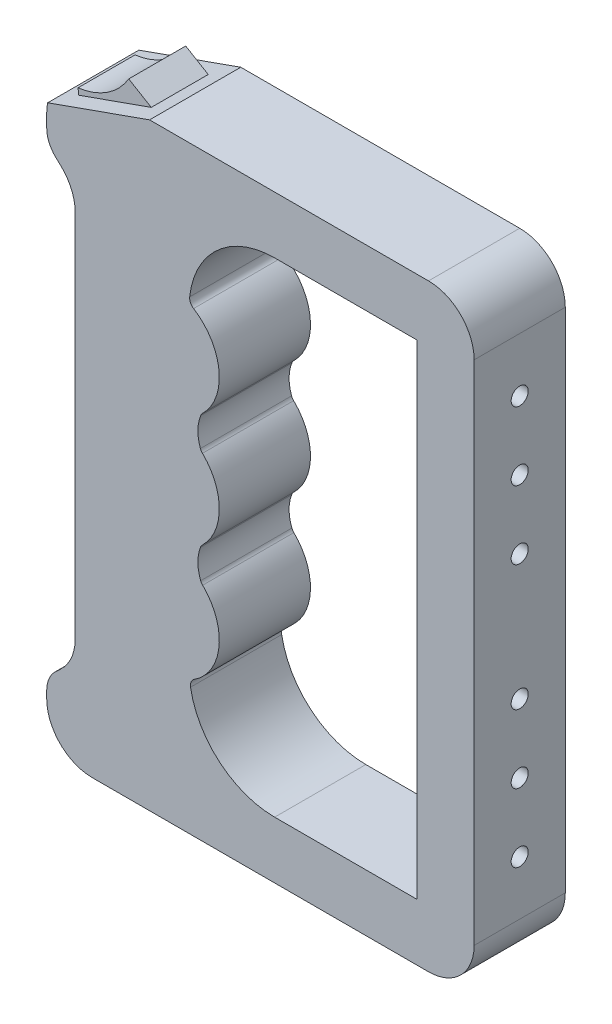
ISO-10303-21;
HEADER;
FILE_DESCRIPTION(('STEP AP214'),'2;1');
FILE_NAME('part.step','',(''),(''),'','','');
FILE_SCHEMA(('AUTOMOTIVE_DESIGN { 1 0 10303 214 1 1 1 1 }'));
ENDSEC;
DATA;
#1=APPLICATION_CONTEXT('core data for automotive mechanical design processes');
#2=APPLICATION_PROTOCOL_DEFINITION('international standard','automotive_design',2000,#1);
#3=PRODUCT_CONTEXT('',#1,'mechanical');
#4=PRODUCT('Part','Part','',(#3));
#5=PRODUCT_RELATED_PRODUCT_CATEGORY('part','',(#4));
#6=PRODUCT_DEFINITION_FORMATION('','',#4);
#7=PRODUCT_DEFINITION_CONTEXT('part definition',#1,'design');
#8=PRODUCT_DEFINITION('design','',#6,#7);
#9=PRODUCT_DEFINITION_SHAPE('','',#8);
#10=(LENGTH_UNIT() NAMED_UNIT(*) SI_UNIT(.MILLI.,.METRE.));
#11=(NAMED_UNIT(*) PLANE_ANGLE_UNIT() SI_UNIT($,.RADIAN.));
#12=(NAMED_UNIT(*) SI_UNIT($,.STERADIAN.) SOLID_ANGLE_UNIT());
#13=UNCERTAINTY_MEASURE_WITH_UNIT(LENGTH_MEASURE(1.E-05),#10,'distance_accuracy_value','');
#14=(GEOMETRIC_REPRESENTATION_CONTEXT(3) GLOBAL_UNCERTAINTY_ASSIGNED_CONTEXT((#13)) GLOBAL_UNIT_ASSIGNED_CONTEXT((#10,
#11,#12)) REPRESENTATION_CONTEXT('',''));
#15=CARTESIAN_POINT('',(0.,0.,0.));
#16=DIRECTION('',(0.,0.,1.));
#17=DIRECTION('',(1.,0.,0.));
#18=AXIS2_PLACEMENT_3D('',#15,#16,#17);
#19=CARTESIAN_POINT('',(-61.1969390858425,-57.7506957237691,8.));
#20=DIRECTION('',(0.,0.,1.));
#21=DIRECTION('',(1.,0.,0.));
#22=AXIS2_PLACEMENT_3D('',#19,#20,#21);
#23=PLANE('',#22);
#24=CARTESIAN_POINT('',(-61.1969390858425,-57.7506957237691,8.));
#25=DIRECTION('',(0.,0.,1.));
#26=DIRECTION('',(1.,0.,0.));
#27=AXIS2_PLACEMENT_3D('',#24,#25,#26);
#28=CIRCLE('',#27,8.);
#29=CARTESIAN_POINT('',(-69.1969390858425,-57.750695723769,8.));
#30=VERTEX_POINT('',#29);
#31=CARTESIAN_POINT('',(-61.1969390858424,-65.7506957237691,8.));
#32=VERTEX_POINT('',#31);
#33=EDGE_CURVE('E511',#30,#32,#28,.T.);
#34=ORIENTED_EDGE('',*,*,#33,.T.);
#35=DIRECTION('',(1.,0.,0.));
#36=VECTOR('',#35,1.);
#37=CARTESIAN_POINT('',(-61.1969390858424,-65.7506957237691,8.));
#38=LINE('',#37,#36);
#39=CARTESIAN_POINT('',(-2.19693908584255,-65.7506957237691,8.));
#40=VERTEX_POINT('',#39);
#41=EDGE_CURVE('E514',#32,#40,#38,.T.);
#42=ORIENTED_EDGE('',*,*,#41,.T.);
#43=CARTESIAN_POINT('',(-2.19693908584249,-57.7506957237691,8.));
#44=DIRECTION('',(0.,0.,1.));
#45=DIRECTION('',(1.,0.,0.));
#46=AXIS2_PLACEMENT_3D('',#43,#44,#45);
#47=CIRCLE('',#46,8.);
#48=CARTESIAN_POINT('',(5.80306091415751,-57.750695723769,8.));
#49=VERTEX_POINT('',#48);
#50=EDGE_CURVE('E517',#40,#49,#47,.T.);
#51=ORIENTED_EDGE('',*,*,#50,.T.);
#52=DIRECTION('',(0.,1.,0.));
#53=VECTOR('',#52,1.);
#54=CARTESIAN_POINT('',(5.8030609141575,31.2493042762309,8.));
#55=LINE('',#54,#53);
#56=CARTESIAN_POINT('',(5.8030609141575,31.2493042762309,8.));
#57=VERTEX_POINT('',#56);
#58=EDGE_CURVE('E519',#49,#57,#55,.T.);
#59=ORIENTED_EDGE('',*,*,#58,.T.);
#60=CARTESIAN_POINT('',(-2.1969390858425,31.2493042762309,8.));
#61=DIRECTION('',(0.,0.,1.));
#62=DIRECTION('',(-1.,0.,0.));
#63=AXIS2_PLACEMENT_3D('',#60,#61,#62);
#64=CIRCLE('',#63,8.);
#65=CARTESIAN_POINT('',(-2.19693908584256,39.2493042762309,8.));
#66=VERTEX_POINT('',#65);
#67=EDGE_CURVE('E521',#57,#66,#64,.T.);
#68=ORIENTED_EDGE('',*,*,#67,.T.);
#69=DIRECTION('',(-1.,0.,0.));
#70=VECTOR('',#69,1.);
#71=CARTESIAN_POINT('',(-51.14409171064,39.2493042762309,8.));
#72=LINE('',#71,#70);
#73=CARTESIAN_POINT('',(-51.14409171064,39.2493042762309,8.));
#74=VERTEX_POINT('',#73);
#75=EDGE_CURVE('E523',#66,#74,#72,.T.);
#76=ORIENTED_EDGE('',*,*,#75,.T.);
#77=DIRECTION('',(-0.942521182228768,-0.334146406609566,0.));
#78=VECTOR('',#77,1.);
#79=CARTESIAN_POINT('',(-69.0224608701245,32.9109928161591,8.));
#80=LINE('',#79,#78);
#81=CARTESIAN_POINT('',(-69.0224608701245,32.9109928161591,8.));
#82=VERTEX_POINT('',#81);
#83=EDGE_CURVE('E525',#74,#82,#80,.T.);
#84=ORIENTED_EDGE('',*,*,#83,.T.);
#85=CARTESIAN_POINT('',(-61.1969390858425,31.2493042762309,8.));
#86=DIRECTION('',(0.,0.,1.));
#87=DIRECTION('',(1.,0.,0.));
#88=AXIS2_PLACEMENT_3D('',#85,#86,#87);
#89=CIRCLE('',#88,8.);
#90=CARTESIAN_POINT('',(-69.1969390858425,31.2493042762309,8.));
#91=VERTEX_POINT('',#90);
#92=EDGE_CURVE('E527',#82,#91,#89,.T.);
#93=ORIENTED_EDGE('',*,*,#92,.T.);
#94=DIRECTION('',(0.,-1.,0.));
#95=VECTOR('',#94,1.);
#96=CARTESIAN_POINT('',(-69.1969390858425,31.2493042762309,8.));
#97=LINE('',#96,#95);
#98=CARTESIAN_POINT('',(-69.1969390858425,28.9716368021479,8.));
#99=VERTEX_POINT('',#98);
#100=EDGE_CURVE('E529',#91,#99,#97,.T.);
#101=ORIENTED_EDGE('',*,*,#100,.T.);
#102=CARTESIAN_POINT('',(-64.1969390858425,28.9716368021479,8.));
#103=DIRECTION('',(0.,0.,1.));
#104=DIRECTION('',(-1.,0.,0.));
#105=AXIS2_PLACEMENT_3D('',#102,#103,#104);
#106=CIRCLE('',#105,5.);
#107=CARTESIAN_POINT('',(-67.60495736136,25.3130289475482,8.));
#108=VERTEX_POINT('',#107);
#109=EDGE_CURVE('E531',#99,#108,#106,.T.);
#110=ORIENTED_EDGE('',*,*,#109,.T.);
#111=DIRECTION('',(0.731721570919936,-0.681603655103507,0.));
#112=VECTOR('',#111,1.);
#113=CARTESIAN_POINT('',(-67.60495736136,25.3130289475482,8.));
#114=LINE('',#113,#112);
#115=CARTESIAN_POINT('',(-66.7441098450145,24.5111435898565,8.));
#116=VERTEX_POINT('',#115);
#117=EDGE_CURVE('E533',#108,#116,#114,.T.);
#118=ORIENTED_EDGE('',*,*,#117,.T.);
#119=CARTESIAN_POINT('',(-72.1969390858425,18.6573710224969,8.));
#120=DIRECTION('',(0.,0.,-1.));
#121=DIRECTION('',(-1.,0.,0.));
#122=AXIS2_PLACEMENT_3D('',#119,#120,#121);
#123=CIRCLE('',#122,7.99999999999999);
#124=CARTESIAN_POINT('',(-64.1969390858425,18.6573710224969,8.));
#125=VERTEX_POINT('',#124);
#126=EDGE_CURVE('E535',#116,#125,#123,.T.);
#127=ORIENTED_EDGE('',*,*,#126,.T.);
#128=DIRECTION('',(0.,-1.,0.));
#129=VECTOR('',#128,1.);
#130=CARTESIAN_POINT('',(-64.1969390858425,18.6573710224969,8.));
#131=LINE('',#130,#129);
#132=CARTESIAN_POINT('',(-64.1969390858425,-46.158762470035,8.));
#133=VERTEX_POINT('',#132);
#134=EDGE_CURVE('E537',#125,#133,#131,.T.);
#135=ORIENTED_EDGE('',*,*,#134,.T.);
#136=CARTESIAN_POINT('',(-72.1969390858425,-46.158762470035,8.));
#137=DIRECTION('',(0.,0.,-1.));
#138=DIRECTION('',(1.,0.,0.));
#139=AXIS2_PLACEMENT_3D('',#136,#137,#138);
#140=CIRCLE('',#139,7.99999999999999);
#141=CARTESIAN_POINT('',(-66.7441098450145,-52.0125350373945,8.));
#142=VERTEX_POINT('',#141);
#143=EDGE_CURVE('E539',#133,#142,#140,.T.);
#144=ORIENTED_EDGE('',*,*,#143,.T.);
#145=DIRECTION('',(-0.731721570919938,-0.681603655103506,0.));
#146=VECTOR('',#145,1.);
#147=CARTESIAN_POINT('',(-67.60495736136,-52.8144203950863,8.));
#148=LINE('',#147,#146);
#149=CARTESIAN_POINT('',(-67.60495736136,-52.8144203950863,8.));
#150=VERTEX_POINT('',#149);
#151=EDGE_CURVE('E541',#142,#150,#148,.T.);
#152=ORIENTED_EDGE('',*,*,#151,.T.);
#153=CARTESIAN_POINT('',(-64.1969390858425,-56.473028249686,8.));
#154=DIRECTION('',(0.,0.,1.));
#155=DIRECTION('',(1.,0.,0.));
#156=AXIS2_PLACEMENT_3D('',#153,#154,#155);
#157=CIRCLE('',#156,5.);
#158=CARTESIAN_POINT('',(-69.1969390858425,-56.473028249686,8.));
#159=VERTEX_POINT('',#158);
#160=EDGE_CURVE('E543',#150,#159,#157,.T.);
#161=ORIENTED_EDGE('',*,*,#160,.T.);
#162=DIRECTION('',(0.,-1.,0.));
#163=VECTOR('',#162,1.);
#164=CARTESIAN_POINT('',(-69.1969390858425,-56.473028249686,8.));
#165=LINE('',#164,#163);
#166=EDGE_CURVE('E545',#159,#30,#165,.T.);
#167=ORIENTED_EDGE('',*,*,#166,.T.);
#168=EDGE_LOOP('',(#34,#42,#51,#59,#68,#76,#84,#93,#101,#110,#118,#127,#135,#144,#152,#161,#167));
#169=FACE_BOUND('',#168,.T.);
#170=DIRECTION('',(-1.,0.,0.));
#171=VECTOR('',#170,1.);
#172=CARTESIAN_POINT('',(-29.1969390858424,29.2493042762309,8.));
#173=LINE('',#172,#171);
#174=CARTESIAN_POINT('',(-4.19693908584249,29.2493042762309,8.));
#175=VERTEX_POINT('',#174);
#176=CARTESIAN_POINT('',(-29.1969390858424,29.2493042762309,8.));
#177=VERTEX_POINT('',#176);
#178=EDGE_CURVE('E398',#175,#177,#173,.T.);
#179=ORIENTED_EDGE('',*,*,#178,.F.);
#180=DIRECTION('',(0.,1.,0.));
#181=VECTOR('',#180,1.);
#182=CARTESIAN_POINT('',(-4.19693908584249,29.2493042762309,8.));
#183=LINE('',#182,#181);
#184=CARTESIAN_POINT('',(-4.19693908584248,-55.7506957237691,8.));
#185=VERTEX_POINT('',#184);
#186=EDGE_CURVE('E396',#185,#175,#183,.T.);
#187=ORIENTED_EDGE('',*,*,#186,.F.);
#188=DIRECTION('',(1.,0.,0.));
#189=VECTOR('',#188,1.);
#190=CARTESIAN_POINT('',(-29.1969390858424,-55.7506957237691,8.));
#191=LINE('',#190,#189);
#192=CARTESIAN_POINT('',(-29.1969390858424,-55.7506957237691,8.));
#193=VERTEX_POINT('',#192);
#194=EDGE_CURVE('E428',#193,#185,#191,.T.);
#195=ORIENTED_EDGE('',*,*,#194,.F.);
#196=CARTESIAN_POINT('',(-29.1969390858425,-40.7506957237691,8.));
#197=DIRECTION('',(0.,0.,1.));
#198=DIRECTION('',(1.,0.,0.));
#199=AXIS2_PLACEMENT_3D('',#196,#197,#198);
#200=CIRCLE('',#199,15.);
#201=CARTESIAN_POINT('',(-43.9637246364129,-43.3854717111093,8.));
#202=VERTEX_POINT('',#201);
#203=EDGE_CURVE('E425',#202,#193,#200,.T.);
#204=ORIENTED_EDGE('',*,*,#203,.F.);
#205=CARTESIAN_POINT('',(-42.4870460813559,-43.1219941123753,8.));
#206=DIRECTION('',(0.,0.,1.));
#207=DIRECTION('',(1.,0.,0.));
#208=AXIS2_PLACEMENT_3D('',#205,#206,#207);
#209=CIRCLE('',#208,1.5);
#210=CARTESIAN_POINT('',(-43.3067687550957,-41.8657876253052,8.));
#211=VERTEX_POINT('',#210);
#212=EDGE_CURVE('E423',#211,#202,#209,.T.);
#213=ORIENTED_EDGE('',*,*,#212,.F.);
#214=CARTESIAN_POINT('',(-48.6021759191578,-33.7506957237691,8.));
#215=DIRECTION('',(0.,0.,-1.));
#216=DIRECTION('',(-1.,0.,0.));
#217=AXIS2_PLACEMENT_3D('',#214,#215,#216);
#218=CIRCLE('',#217,9.68999760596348);
#219=CARTESIAN_POINT('',(-41.8297480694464,-26.8203079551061,8.));
#220=VERTEX_POINT('',#219);
#221=EDGE_CURVE('E421',#220,#211,#218,.T.);
#222=ORIENTED_EDGE('',*,*,#221,.F.);
#223=CARTESIAN_POINT('',(-40.7813843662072,-25.7474922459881,8.));
#224=DIRECTION('',(0.,0.,1.));
#225=DIRECTION('',(1.,0.,0.));
#226=AXIS2_PLACEMENT_3D('',#223,#224,#225);
#227=CIRCLE('',#226,1.5);
#228=CARTESIAN_POINT('',(-42.1750963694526,-26.3020793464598,8.));
#229=VERTEX_POINT('',#228);
#230=EDGE_CURVE('E419',#229,#220,#227,.T.);
#231=ORIENTED_EDGE('',*,*,#230,.F.);
#232=CARTESIAN_POINT('',(-35.6842430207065,-23.7192332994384,8.));
#233=DIRECTION('',(0.,0.,1.));
#234=DIRECTION('',(-1.,0.,0.));
#235=AXIS2_PLACEMENT_3D('',#232,#233,#234);
#236=CIRCLE('',#235,6.98586221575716);
#237=CARTESIAN_POINT('',(-42.2247280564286,-21.2647829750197,8.));
#238=VERTEX_POINT('',#237);
#239=EDGE_CURVE('E417',#238,#229,#236,.T.);
#240=ORIENTED_EDGE('',*,*,#239,.F.);
#241=CARTESIAN_POINT('',(-40.8203591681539,-21.7918010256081,8.));
#242=DIRECTION('',(0.,0.,1.));
#243=DIRECTION('',(1.,0.,0.));
#244=AXIS2_PLACEMENT_3D('',#241,#242,#243);
#245=CIRCLE('',#244,1.5);
#246=CARTESIAN_POINT('',(-41.8634983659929,-20.7139046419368,8.));
#247=VERTEX_POINT('',#246);
#248=EDGE_CURVE('E415',#247,#238,#245,.T.);
#249=ORIENTED_EDGE('',*,*,#248,.F.);
#250=CARTESIAN_POINT('',(-48.6021759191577,-13.7506957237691,8.));
#251=DIRECTION('',(0.,0.,-1.));
#252=DIRECTION('',(1.,0.,0.));
#253=AXIS2_PLACEMENT_3D('',#250,#251,#252);
#254=CIRCLE('',#253,9.68999760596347);
#255=CARTESIAN_POINT('',(-41.8634983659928,-6.78748680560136,8.));
#256=VERTEX_POINT('',#255);
#257=EDGE_CURVE('E413',#256,#247,#254,.T.);
#258=ORIENTED_EDGE('',*,*,#257,.F.);
#259=CARTESIAN_POINT('',(-40.8203591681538,-5.70959042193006,8.));
#260=DIRECTION('',(0.,0.,1.));
#261=DIRECTION('',(1.,0.,0.));
#262=AXIS2_PLACEMENT_3D('',#259,#260,#261);
#263=CIRCLE('',#262,1.5);
#264=CARTESIAN_POINT('',(-42.2247280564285,-6.23660847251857,8.));
#265=VERTEX_POINT('',#264);
#266=EDGE_CURVE('E411',#265,#256,#263,.T.);
#267=ORIENTED_EDGE('',*,*,#266,.F.);
#268=CARTESIAN_POINT('',(-35.6842430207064,-3.78215814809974,8.));
#269=DIRECTION('',(0.,0.,1.));
#270=DIRECTION('',(1.,0.,0.));
#271=AXIS2_PLACEMENT_3D('',#268,#269,#270);
#272=CIRCLE('',#271,6.98586221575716);
#273=CARTESIAN_POINT('',(-42.1750963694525,-1.1993121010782,8.));
#274=VERTEX_POINT('',#273);
#275=EDGE_CURVE('E409',#274,#265,#272,.T.);
#276=ORIENTED_EDGE('',*,*,#275,.F.);
#277=CARTESIAN_POINT('',(-40.7813843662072,-1.75389920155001,8.));
#278=DIRECTION('',(0.,0.,1.));
#279=DIRECTION('',(-1.,0.,0.));
#280=AXIS2_PLACEMENT_3D('',#277,#278,#279);
#281=CIRCLE('',#280,1.5);
#282=CARTESIAN_POINT('',(-41.8297480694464,-0.681083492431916,8.));
#283=VERTEX_POINT('',#282);
#284=EDGE_CURVE('E407',#283,#274,#281,.T.);
#285=ORIENTED_EDGE('',*,*,#284,.F.);
#286=CARTESIAN_POINT('',(-48.6021759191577,6.24930427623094,8.));
#287=DIRECTION('',(0.,0.,-1.));
#288=DIRECTION('',(1.,0.,0.));
#289=AXIS2_PLACEMENT_3D('',#286,#287,#288);
#290=CIRCLE('',#289,9.68999760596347);
#291=CARTESIAN_POINT('',(-43.4203727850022,14.4374035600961,8.));
#292=VERTEX_POINT('',#291);
#293=EDGE_CURVE('E405',#292,#283,#290,.T.);
#294=ORIENTED_EDGE('',*,*,#293,.F.);
#295=CARTESIAN_POINT('',(-42.6182358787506,15.7049115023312,8.));
#296=DIRECTION('',(0.,0.,1.));
#297=DIRECTION('',(-1.,0.,0.));
#298=AXIS2_PLACEMENT_3D('',#295,#296,#297);
#299=CIRCLE('',#298,1.5);
#300=CARTESIAN_POINT('',(-44.1094910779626,15.8666456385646,8.));
#301=VERTEX_POINT('',#300);
#302=EDGE_CURVE('E403',#301,#292,#299,.T.);
#303=ORIENTED_EDGE('',*,*,#302,.F.);
#304=CARTESIAN_POINT('',(-29.1969390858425,14.2493042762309,8.));
#305=DIRECTION('',(0.,0.,1.));
#306=DIRECTION('',(1.,0.,0.));
#307=AXIS2_PLACEMENT_3D('',#304,#305,#306);
#308=CIRCLE('',#307,15.);
#309=EDGE_CURVE('E401',#177,#301,#308,.T.);
#310=ORIENTED_EDGE('',*,*,#309,.F.);
#311=EDGE_LOOP('',(#179,#187,#195,#204,#213,#222,#231,#240,#249,#258,#267,#276,#285,#294,#303,#310));
#312=FACE_BOUND('',#311,.T.);
#313=ADVANCED_FACE('F32',(#169,#312),#23,.T.);
#314=CARTESIAN_POINT('',(-61.1969390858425,-57.7506957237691,-8.));
#315=DIRECTION('',(0.,0.,1.));
#316=DIRECTION('',(1.,0.,0.));
#317=AXIS2_PLACEMENT_3D('',#314,#315,#316);
#318=PLANE('',#317);
#319=CARTESIAN_POINT('',(-61.1969390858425,-57.7506957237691,-8.));
#320=DIRECTION('',(0.,0.,1.));
#321=DIRECTION('',(1.,0.,0.));
#322=AXIS2_PLACEMENT_3D('',#319,#320,#321);
#323=CIRCLE('',#322,8.);
#324=CARTESIAN_POINT('',(-69.1969390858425,-57.750695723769,-8.));
#325=VERTEX_POINT('',#324);
#326=CARTESIAN_POINT('',(-61.1969390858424,-65.7506957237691,-8.));
#327=VERTEX_POINT('',#326);
#328=EDGE_CURVE('E510',#325,#327,#323,.T.);
#329=ORIENTED_EDGE('',*,*,#328,.F.);
#330=DIRECTION('',(0.,-1.,0.));
#331=VECTOR('',#330,1.);
#332=CARTESIAN_POINT('',(-69.1969390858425,-56.473028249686,-8.));
#333=LINE('',#332,#331);
#334=CARTESIAN_POINT('',(-69.1969390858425,-56.473028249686,-8.));
#335=VERTEX_POINT('',#334);
#336=EDGE_CURVE('E515',#335,#325,#333,.T.);
#337=ORIENTED_EDGE('',*,*,#336,.F.);
#338=CARTESIAN_POINT('',(-64.1969390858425,-56.473028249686,-8.));
#339=DIRECTION('',(0.,0.,1.));
#340=DIRECTION('',(1.,0.,0.));
#341=AXIS2_PLACEMENT_3D('',#338,#339,#340);
#342=CIRCLE('',#341,5.);
#343=CARTESIAN_POINT('',(-67.60495736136,-52.8144203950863,-8.));
#344=VERTEX_POINT('',#343);
#345=EDGE_CURVE('E578',#344,#335,#342,.T.);
#346=ORIENTED_EDGE('',*,*,#345,.F.);
#347=DIRECTION('',(-0.731721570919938,-0.681603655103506,0.));
#348=VECTOR('',#347,1.);
#349=CARTESIAN_POINT('',(-67.60495736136,-52.8144203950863,-8.));
#350=LINE('',#349,#348);
#351=CARTESIAN_POINT('',(-66.7441098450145,-52.0125350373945,-8.));
#352=VERTEX_POINT('',#351);
#353=EDGE_CURVE('E576',#352,#344,#350,.T.);
#354=ORIENTED_EDGE('',*,*,#353,.F.);
#355=CARTESIAN_POINT('',(-72.1969390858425,-46.158762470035,-8.));
#356=DIRECTION('',(0.,0.,-1.));
#357=DIRECTION('',(1.,0.,0.));
#358=AXIS2_PLACEMENT_3D('',#355,#356,#357);
#359=CIRCLE('',#358,7.99999999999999);
#360=CARTESIAN_POINT('',(-64.1969390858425,-46.158762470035,-8.));
#361=VERTEX_POINT('',#360);
#362=EDGE_CURVE('E574',#361,#352,#359,.T.);
#363=ORIENTED_EDGE('',*,*,#362,.F.);
#364=DIRECTION('',(0.,-1.,0.));
#365=VECTOR('',#364,1.);
#366=CARTESIAN_POINT('',(-64.1969390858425,18.6573710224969,-8.));
#367=LINE('',#366,#365);
#368=CARTESIAN_POINT('',(-64.1969390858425,18.6573710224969,-8.));
#369=VERTEX_POINT('',#368);
#370=EDGE_CURVE('E572',#369,#361,#367,.T.);
#371=ORIENTED_EDGE('',*,*,#370,.F.);
#372=CARTESIAN_POINT('',(-72.1969390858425,18.6573710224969,-8.));
#373=DIRECTION('',(0.,0.,-1.));
#374=DIRECTION('',(-1.,0.,0.));
#375=AXIS2_PLACEMENT_3D('',#372,#373,#374);
#376=CIRCLE('',#375,7.99999999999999);
#377=CARTESIAN_POINT('',(-66.7441098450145,24.5111435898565,-8.));
#378=VERTEX_POINT('',#377);
#379=EDGE_CURVE('E570',#378,#369,#376,.T.);
#380=ORIENTED_EDGE('',*,*,#379,.F.);
#381=DIRECTION('',(0.731721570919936,-0.681603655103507,0.));
#382=VECTOR('',#381,1.);
#383=CARTESIAN_POINT('',(-67.60495736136,25.3130289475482,-8.));
#384=LINE('',#383,#382);
#385=CARTESIAN_POINT('',(-67.60495736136,25.3130289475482,-8.));
#386=VERTEX_POINT('',#385);
#387=EDGE_CURVE('E568',#386,#378,#384,.T.);
#388=ORIENTED_EDGE('',*,*,#387,.F.);
#389=CARTESIAN_POINT('',(-64.1969390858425,28.9716368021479,-8.));
#390=DIRECTION('',(0.,0.,1.));
#391=DIRECTION('',(-1.,0.,0.));
#392=AXIS2_PLACEMENT_3D('',#389,#390,#391);
#393=CIRCLE('',#392,5.);
#394=CARTESIAN_POINT('',(-69.1969390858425,28.9716368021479,-8.));
#395=VERTEX_POINT('',#394);
#396=EDGE_CURVE('E566',#395,#386,#393,.T.);
#397=ORIENTED_EDGE('',*,*,#396,.F.);
#398=DIRECTION('',(0.,-1.,0.));
#399=VECTOR('',#398,1.);
#400=CARTESIAN_POINT('',(-69.1969390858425,31.2493042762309,-8.));
#401=LINE('',#400,#399);
#402=CARTESIAN_POINT('',(-69.1969390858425,31.2493042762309,-8.));
#403=VERTEX_POINT('',#402);
#404=EDGE_CURVE('E564',#403,#395,#401,.T.);
#405=ORIENTED_EDGE('',*,*,#404,.F.);
#406=CARTESIAN_POINT('',(-61.1969390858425,31.2493042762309,-8.));
#407=DIRECTION('',(0.,0.,1.));
#408=DIRECTION('',(1.,0.,0.));
#409=AXIS2_PLACEMENT_3D('',#406,#407,#408);
#410=CIRCLE('',#409,8.);
#411=CARTESIAN_POINT('',(-69.0224608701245,32.9109928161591,-8.));
#412=VERTEX_POINT('',#411);
#413=EDGE_CURVE('E562',#412,#403,#410,.T.);
#414=ORIENTED_EDGE('',*,*,#413,.F.);
#415=DIRECTION('',(-0.942521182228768,-0.334146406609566,0.));
#416=VECTOR('',#415,1.);
#417=CARTESIAN_POINT('',(-69.0224608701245,32.9109928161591,-8.));
#418=LINE('',#417,#416);
#419=CARTESIAN_POINT('',(-51.14409171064,39.2493042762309,-8.));
#420=VERTEX_POINT('',#419);
#421=EDGE_CURVE('E560',#420,#412,#418,.T.);
#422=ORIENTED_EDGE('',*,*,#421,.F.);
#423=DIRECTION('',(-1.,0.,0.));
#424=VECTOR('',#423,1.);
#425=CARTESIAN_POINT('',(-51.14409171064,39.2493042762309,-8.));
#426=LINE('',#425,#424);
#427=CARTESIAN_POINT('',(-2.19693908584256,39.2493042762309,-8.));
#428=VERTEX_POINT('',#427);
#429=EDGE_CURVE('E558',#428,#420,#426,.T.);
#430=ORIENTED_EDGE('',*,*,#429,.F.);
#431=CARTESIAN_POINT('',(-2.1969390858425,31.2493042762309,-8.));
#432=DIRECTION('',(0.,0.,1.));
#433=DIRECTION('',(-1.,0.,0.));
#434=AXIS2_PLACEMENT_3D('',#431,#432,#433);
#435=CIRCLE('',#434,8.);
#436=CARTESIAN_POINT('',(5.8030609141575,31.2493042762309,-8.));
#437=VERTEX_POINT('',#436);
#438=EDGE_CURVE('E556',#437,#428,#435,.T.);
#439=ORIENTED_EDGE('',*,*,#438,.F.);
#440=DIRECTION('',(0.,1.,0.));
#441=VECTOR('',#440,1.);
#442=CARTESIAN_POINT('',(5.8030609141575,31.2493042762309,-8.));
#443=LINE('',#442,#441);
#444=CARTESIAN_POINT('',(5.80306091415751,-57.750695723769,-8.));
#445=VERTEX_POINT('',#444);
#446=EDGE_CURVE('E554',#445,#437,#443,.T.);
#447=ORIENTED_EDGE('',*,*,#446,.F.);
#448=CARTESIAN_POINT('',(-2.19693908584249,-57.7506957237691,-8.));
#449=DIRECTION('',(0.,0.,1.));
#450=DIRECTION('',(1.,0.,0.));
#451=AXIS2_PLACEMENT_3D('',#448,#449,#450);
#452=CIRCLE('',#451,8.);
#453=CARTESIAN_POINT('',(-2.19693908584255,-65.7506957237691,-8.));
#454=VERTEX_POINT('',#453);
#455=EDGE_CURVE('E552',#454,#445,#452,.T.);
#456=ORIENTED_EDGE('',*,*,#455,.F.);
#457=DIRECTION('',(1.,0.,0.));
#458=VECTOR('',#457,1.);
#459=CARTESIAN_POINT('',(-61.1969390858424,-65.7506957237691,-8.));
#460=LINE('',#459,#458);
#461=EDGE_CURVE('E550',#327,#454,#460,.T.);
#462=ORIENTED_EDGE('',*,*,#461,.F.);
#463=EDGE_LOOP('',(#329,#337,#346,#354,#363,#371,#380,#388,#397,#405,#414,#422,#430,#439,#447,
#456,#462));
#464=FACE_BOUND('',#463,.T.);
#465=DIRECTION('',(0.,1.,0.));
#466=VECTOR('',#465,1.);
#467=CARTESIAN_POINT('',(-4.19693908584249,29.2493042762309,-8.));
#468=LINE('',#467,#466);
#469=CARTESIAN_POINT('',(-4.19693908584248,-55.7506957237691,-8.));
#470=VERTEX_POINT('',#469);
#471=CARTESIAN_POINT('',(-4.19693908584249,29.2493042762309,-8.));
#472=VERTEX_POINT('',#471);
#473=EDGE_CURVE('E395',#470,#472,#468,.T.);
#474=ORIENTED_EDGE('',*,*,#473,.T.);
#475=DIRECTION('',(-1.,0.,0.));
#476=VECTOR('',#475,1.);
#477=CARTESIAN_POINT('',(-29.1969390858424,29.2493042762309,-8.));
#478=LINE('',#477,#476);
#479=CARTESIAN_POINT('',(-29.1969390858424,29.2493042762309,-8.));
#480=VERTEX_POINT('',#479);
#481=EDGE_CURVE('E433',#472,#480,#478,.T.);
#482=ORIENTED_EDGE('',*,*,#481,.T.);
#483=CARTESIAN_POINT('',(-29.1969390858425,14.2493042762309,-8.));
#484=DIRECTION('',(0.,0.,1.));
#485=DIRECTION('',(1.,0.,0.));
#486=AXIS2_PLACEMENT_3D('',#483,#484,#485);
#487=CIRCLE('',#486,15.);
#488=CARTESIAN_POINT('',(-44.1094910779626,15.8666456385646,-8.));
#489=VERTEX_POINT('',#488);
#490=EDGE_CURVE('E436',#480,#489,#487,.T.);
#491=ORIENTED_EDGE('',*,*,#490,.T.);
#492=CARTESIAN_POINT('',(-42.6182358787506,15.7049115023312,-8.));
#493=DIRECTION('',(0.,0.,1.));
#494=DIRECTION('',(-1.,0.,0.));
#495=AXIS2_PLACEMENT_3D('',#492,#493,#494);
#496=CIRCLE('',#495,1.5);
#497=CARTESIAN_POINT('',(-43.4203727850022,14.4374035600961,-8.));
#498=VERTEX_POINT('',#497);
#499=EDGE_CURVE('E439',#489,#498,#496,.T.);
#500=ORIENTED_EDGE('',*,*,#499,.T.);
#501=CARTESIAN_POINT('',(-48.6021759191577,6.24930427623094,-8.));
#502=DIRECTION('',(0.,0.,-1.));
#503=DIRECTION('',(1.,0.,0.));
#504=AXIS2_PLACEMENT_3D('',#501,#502,#503);
#505=CIRCLE('',#504,9.68999760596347);
#506=CARTESIAN_POINT('',(-41.8297480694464,-0.681083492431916,-8.));
#507=VERTEX_POINT('',#506);
#508=EDGE_CURVE('E442',#498,#507,#505,.T.);
#509=ORIENTED_EDGE('',*,*,#508,.T.);
#510=CARTESIAN_POINT('',(-40.7813843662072,-1.75389920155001,-8.));
#511=DIRECTION('',(0.,0.,1.));
#512=DIRECTION('',(-1.,0.,0.));
#513=AXIS2_PLACEMENT_3D('',#510,#511,#512);
#514=CIRCLE('',#513,1.5);
#515=CARTESIAN_POINT('',(-42.1750963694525,-1.1993121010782,-8.));
#516=VERTEX_POINT('',#515);
#517=EDGE_CURVE('E445',#507,#516,#514,.T.);
#518=ORIENTED_EDGE('',*,*,#517,.T.);
#519=CARTESIAN_POINT('',(-35.6842430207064,-3.78215814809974,-8.));
#520=DIRECTION('',(0.,0.,1.));
#521=DIRECTION('',(1.,0.,0.));
#522=AXIS2_PLACEMENT_3D('',#519,#520,#521);
#523=CIRCLE('',#522,6.98586221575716);
#524=CARTESIAN_POINT('',(-42.2247280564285,-6.23660847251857,-8.));
#525=VERTEX_POINT('',#524);
#526=EDGE_CURVE('E448',#516,#525,#523,.T.);
#527=ORIENTED_EDGE('',*,*,#526,.T.);
#528=CARTESIAN_POINT('',(-40.8203591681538,-5.70959042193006,-8.));
#529=DIRECTION('',(0.,0.,1.));
#530=DIRECTION('',(1.,0.,0.));
#531=AXIS2_PLACEMENT_3D('',#528,#529,#530);
#532=CIRCLE('',#531,1.5);
#533=CARTESIAN_POINT('',(-41.8634983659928,-6.78748680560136,-8.));
#534=VERTEX_POINT('',#533);
#535=EDGE_CURVE('E451',#525,#534,#532,.T.);
#536=ORIENTED_EDGE('',*,*,#535,.T.);
#537=CARTESIAN_POINT('',(-48.6021759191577,-13.7506957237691,-8.));
#538=DIRECTION('',(0.,0.,-1.));
#539=DIRECTION('',(1.,0.,0.));
#540=AXIS2_PLACEMENT_3D('',#537,#538,#539);
#541=CIRCLE('',#540,9.68999760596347);
#542=CARTESIAN_POINT('',(-41.8634983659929,-20.7139046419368,-8.));
#543=VERTEX_POINT('',#542);
#544=EDGE_CURVE('E454',#534,#543,#541,.T.);
#545=ORIENTED_EDGE('',*,*,#544,.T.);
#546=CARTESIAN_POINT('',(-40.8203591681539,-21.7918010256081,-8.));
#547=DIRECTION('',(0.,0.,1.));
#548=DIRECTION('',(1.,0.,0.));
#549=AXIS2_PLACEMENT_3D('',#546,#547,#548);
#550=CIRCLE('',#549,1.5);
#551=CARTESIAN_POINT('',(-42.2247280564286,-21.2647829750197,-8.));
#552=VERTEX_POINT('',#551);
#553=EDGE_CURVE('E457',#543,#552,#550,.T.);
#554=ORIENTED_EDGE('',*,*,#553,.T.);
#555=CARTESIAN_POINT('',(-35.6842430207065,-23.7192332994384,-8.));
#556=DIRECTION('',(0.,0.,1.));
#557=DIRECTION('',(-1.,0.,0.));
#558=AXIS2_PLACEMENT_3D('',#555,#556,#557);
#559=CIRCLE('',#558,6.98586221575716);
#560=CARTESIAN_POINT('',(-42.1750963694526,-26.3020793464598,-8.));
#561=VERTEX_POINT('',#560);
#562=EDGE_CURVE('E460',#552,#561,#559,.T.);
#563=ORIENTED_EDGE('',*,*,#562,.T.);
#564=CARTESIAN_POINT('',(-40.7813843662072,-25.7474922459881,-8.));
#565=DIRECTION('',(0.,0.,1.));
#566=DIRECTION('',(1.,0.,0.));
#567=AXIS2_PLACEMENT_3D('',#564,#565,#566);
#568=CIRCLE('',#567,1.5);
#569=CARTESIAN_POINT('',(-41.8297480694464,-26.8203079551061,-8.));
#570=VERTEX_POINT('',#569);
#571=EDGE_CURVE('E463',#561,#570,#568,.T.);
#572=ORIENTED_EDGE('',*,*,#571,.T.);
#573=CARTESIAN_POINT('',(-48.6021759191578,-33.7506957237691,-8.));
#574=DIRECTION('',(0.,0.,-1.));
#575=DIRECTION('',(-1.,0.,0.));
#576=AXIS2_PLACEMENT_3D('',#573,#574,#575);
#577=CIRCLE('',#576,9.68999760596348);
#578=CARTESIAN_POINT('',(-43.3067687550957,-41.8657876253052,-8.));
#579=VERTEX_POINT('',#578);
#580=EDGE_CURVE('E466',#570,#579,#577,.T.);
#581=ORIENTED_EDGE('',*,*,#580,.T.);
#582=CARTESIAN_POINT('',(-42.4870460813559,-43.1219941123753,-8.));
#583=DIRECTION('',(0.,0.,1.));
#584=DIRECTION('',(1.,0.,0.));
#585=AXIS2_PLACEMENT_3D('',#582,#583,#584);
#586=CIRCLE('',#585,1.5);
#587=CARTESIAN_POINT('',(-43.9637246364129,-43.3854717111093,-8.));
#588=VERTEX_POINT('',#587);
#589=EDGE_CURVE('E469',#579,#588,#586,.T.);
#590=ORIENTED_EDGE('',*,*,#589,.T.);
#591=CARTESIAN_POINT('',(-29.1969390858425,-40.7506957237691,-8.));
#592=DIRECTION('',(0.,0.,1.));
#593=DIRECTION('',(1.,0.,0.));
#594=AXIS2_PLACEMENT_3D('',#591,#592,#593);
#595=CIRCLE('',#594,15.);
#596=CARTESIAN_POINT('',(-29.1969390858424,-55.7506957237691,-8.));
#597=VERTEX_POINT('',#596);
#598=EDGE_CURVE('E472',#588,#597,#595,.T.);
#599=ORIENTED_EDGE('',*,*,#598,.T.);
#600=DIRECTION('',(1.,0.,0.));
#601=VECTOR('',#600,1.);
#602=CARTESIAN_POINT('',(-29.1969390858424,-55.7506957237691,-8.));
#603=LINE('',#602,#601);
#604=EDGE_CURVE('E399',#597,#470,#603,.T.);
#605=ORIENTED_EDGE('',*,*,#604,.T.);
#606=EDGE_LOOP('',(#474,#482,#491,#500,#509,#518,#527,#536,#545,#554,#563,#572,#581,#590,#599,#605));
#607=FACE_BOUND('',#606,.T.);
#608=ADVANCED_FACE('F665',(#464,#607),#318,.F.);
#609=CARTESIAN_POINT('',(-61.1969390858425,-57.7506957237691,8.));
#610=DIRECTION('',(0.,0.,-1.));
#611=DIRECTION('',(-1.,0.,0.));
#612=AXIS2_PLACEMENT_3D('',#609,#610,#611);
#613=CYLINDRICAL_SURFACE('',#612,8.);
#614=ORIENTED_EDGE('',*,*,#328,.T.);
#615=DIRECTION('',(0.,0.,-1.));
#616=VECTOR('',#615,1.);
#617=CARTESIAN_POINT('',(-61.1969390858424,-65.7506957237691,8.));
#618=LINE('',#617,#616);
#619=EDGE_CURVE('E628',#32,#327,#618,.T.);
#620=ORIENTED_EDGE('',*,*,#619,.F.);
#621=ORIENTED_EDGE('',*,*,#33,.F.);
#622=DIRECTION('',(0.,0.,-1.));
#623=VECTOR('',#622,1.);
#624=CARTESIAN_POINT('',(-69.1969390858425,-57.750695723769,8.));
#625=LINE('',#624,#623);
#626=EDGE_CURVE('E547',#30,#325,#625,.T.);
#627=ORIENTED_EDGE('',*,*,#626,.T.);
#628=EDGE_LOOP('',(#614,#620,#621,#627));
#629=FACE_BOUND('',#628,.T.);
#630=ADVANCED_FACE('F34',(#629),#613,.T.);
#631=CARTESIAN_POINT('',(-61.1969390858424,-65.7506957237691,8.));
#632=DIRECTION('',(0.,1.,0.));
#633=DIRECTION('',(0.,0.,1.));
#634=AXIS2_PLACEMENT_3D('',#631,#632,#633);
#635=PLANE('',#634);
#636=DIRECTION('',(1.,0.,0.));
#637=VECTOR('',#636,1.);
#638=CARTESIAN_POINT('',(-56.2184440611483,-65.7506957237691,-2.));
#639=LINE('',#638,#637);
#640=CARTESIAN_POINT('',(-56.2184440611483,-65.7506957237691,-2.));
#641=VERTEX_POINT('',#640);
#642=CARTESIAN_POINT('',(-52.4945641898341,-65.7506957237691,-2.));
#643=VERTEX_POINT('',#642);
#644=EDGE_CURVE('E322',#641,#643,#639,.T.);
#645=ORIENTED_EDGE('',*,*,#644,.F.);
#646=DIRECTION('',(0.,0.,-1.));
#647=VECTOR('',#646,1.);
#648=CARTESIAN_POINT('',(-56.2184440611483,-65.7506957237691,2.));
#649=LINE('',#648,#647);
#650=CARTESIAN_POINT('',(-56.2184440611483,-65.7506957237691,2.));
#651=VERTEX_POINT('',#650);
#652=EDGE_CURVE('E47',#651,#641,#649,.T.);
#653=ORIENTED_EDGE('',*,*,#652,.F.);
#654=DIRECTION('',(-1.,0.,0.));
#655=VECTOR('',#654,1.);
#656=CARTESIAN_POINT('',(-56.2184440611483,-65.7506957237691,2.));
#657=LINE('',#656,#655);
#658=CARTESIAN_POINT('',(-52.4945641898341,-65.7506957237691,2.));
#659=VERTEX_POINT('',#658);
#660=EDGE_CURVE('E313',#659,#651,#657,.T.);
#661=ORIENTED_EDGE('',*,*,#660,.F.);
#662=DIRECTION('',(0.,0.,1.));
#663=VECTOR('',#662,1.);
#664=CARTESIAN_POINT('',(-52.4945641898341,-65.7506957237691,2.));
#665=LINE('',#664,#663);
#666=EDGE_CURVE('E316',#643,#659,#665,.T.);
#667=ORIENTED_EDGE('',*,*,#666,.F.);
#668=EDGE_LOOP('',(#645,#653,#661,#667));
#669=FACE_BOUND('',#668,.T.);
#670=CARTESIAN_POINT('',(-58.685514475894,-65.7506957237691,0.));
#671=DIRECTION('',(0.,-1.,0.));
#672=DIRECTION('',(0.,0.,-1.));
#673=AXIS2_PLACEMENT_3D('',#670,#671,#672);
#674=CIRCLE('',#673,2.);
#675=CARTESIAN_POINT('',(-58.685514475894,-65.7506957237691,-2.));
#676=VERTEX_POINT('',#675);
#677=EDGE_CURVE('E328',#676,#676,#674,.T.);
#678=ORIENTED_EDGE('',*,*,#677,.F.);
#679=EDGE_LOOP('',(#678));
#680=FACE_BOUND('',#679,.T.);
#681=ORIENTED_EDGE('',*,*,#461,.T.);
#682=DIRECTION('',(0.,0.,-1.));
#683=VECTOR('',#682,1.);
#684=CARTESIAN_POINT('',(-2.19693908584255,-65.7506957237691,8.));
#685=LINE('',#684,#683);
#686=EDGE_CURVE('E625',#40,#454,#685,.T.);
#687=ORIENTED_EDGE('',*,*,#686,.F.);
#688=ORIENTED_EDGE('',*,*,#41,.F.);
#689=ORIENTED_EDGE('',*,*,#619,.T.);
#690=EDGE_LOOP('',(#681,#687,#688,#689));
#691=FACE_BOUND('',#690,.T.);
#692=ADVANCED_FACE('F734',(#669,#680,#691),#635,.F.);
#693=CARTESIAN_POINT('',(-2.19693908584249,-57.7506957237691,8.));
#694=DIRECTION('',(0.,0.,-1.));
#695=DIRECTION('',(-1.,0.,0.));
#696=AXIS2_PLACEMENT_3D('',#693,#694,#695);
#697=CYLINDRICAL_SURFACE('',#696,8.);
#698=ORIENTED_EDGE('',*,*,#455,.T.);
#699=DIRECTION('',(0.,0.,-1.));
#700=VECTOR('',#699,1.);
#701=CARTESIAN_POINT('',(5.80306091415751,-57.750695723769,8.));
#702=LINE('',#701,#700);
#703=EDGE_CURVE('E622',#49,#445,#702,.T.);
#704=ORIENTED_EDGE('',*,*,#703,.F.);
#705=ORIENTED_EDGE('',*,*,#50,.F.);
#706=ORIENTED_EDGE('',*,*,#686,.T.);
#707=EDGE_LOOP('',(#698,#704,#705,#706));
#708=FACE_BOUND('',#707,.T.);
#709=ADVANCED_FACE('F731',(#708),#697,.T.);
#710=CARTESIAN_POINT('',(5.8030609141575,31.2493042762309,8.));
#711=DIRECTION('',(-1.,0.,0.));
#712=DIRECTION('',(0.,-1.,0.));
#713=AXIS2_PLACEMENT_3D('',#710,#711,#712);
#714=PLANE('',#713);
#715=CARTESIAN_POINT('',(5.8030609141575,-2.23122467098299,0.));
#716=DIRECTION('',(1.,0.,0.));
#717=DIRECTION('',(0.,-1.,0.));
#718=AXIS2_PLACEMENT_3D('',#715,#716,#717);
#719=CIRCLE('',#718,1.5);
#720=CARTESIAN_POINT('',(5.8030609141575,-3.73122467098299,0.));
#721=VERTEX_POINT('',#720);
#722=EDGE_CURVE('E335',#721,#721,#719,.T.);
#723=ORIENTED_EDGE('',*,*,#722,.F.);
#724=EDGE_LOOP('',(#723));
#725=FACE_BOUND('',#724,.T.);
#726=CARTESIAN_POINT('',(5.8030609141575,9.76877532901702,-1.25693400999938E-13));
#727=DIRECTION('',(1.,0.,0.));
#728=DIRECTION('',(0.,-1.,0.));
#729=AXIS2_PLACEMENT_3D('',#726,#727,#728);
#730=CIRCLE('',#729,1.5);
#731=CARTESIAN_POINT('',(5.8030609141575,8.26877532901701,-1.25693400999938E-13));
#732=VERTEX_POINT('',#731);
#733=EDGE_CURVE('E341',#732,#732,#730,.T.);
#734=ORIENTED_EDGE('',*,*,#733,.F.);
#735=EDGE_LOOP('',(#734));
#736=FACE_BOUND('',#735,.T.);
#737=CARTESIAN_POINT('',(5.8030609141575,21.768775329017,-2.51386801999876E-13));
#738=DIRECTION('',(1.,0.,0.));
#739=DIRECTION('',(0.,-1.,0.));
#740=AXIS2_PLACEMENT_3D('',#737,#738,#739);
#741=CIRCLE('',#740,1.5);
#742=CARTESIAN_POINT('',(5.8030609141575,20.268775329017,-2.51386801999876E-13));
#743=VERTEX_POINT('',#742);
#744=EDGE_CURVE('E347',#743,#743,#741,.T.);
#745=ORIENTED_EDGE('',*,*,#744,.F.);
#746=EDGE_LOOP('',(#745));
#747=FACE_BOUND('',#746,.T.);
#748=CARTESIAN_POINT('',(5.80306091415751,-48.2701667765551,-2.51386801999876E-13));
#749=DIRECTION('',(1.,0.,0.));
#750=DIRECTION('',(0.,1.,0.));
#751=AXIS2_PLACEMENT_3D('',#748,#749,#750);
#752=CIRCLE('',#751,1.5);
#753=CARTESIAN_POINT('',(5.80306091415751,-46.7701667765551,-2.51386801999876E-13));
#754=VERTEX_POINT('',#753);
#755=EDGE_CURVE('E353',#754,#754,#752,.T.);
#756=ORIENTED_EDGE('',*,*,#755,.F.);
#757=EDGE_LOOP('',(#756));
#758=FACE_BOUND('',#757,.T.);
#759=CARTESIAN_POINT('',(5.80306091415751,-36.2701667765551,-1.25693400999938E-13));
#760=DIRECTION('',(1.,0.,0.));
#761=DIRECTION('',(0.,1.,0.));
#762=AXIS2_PLACEMENT_3D('',#759,#760,#761);
#763=CIRCLE('',#762,1.5);
#764=CARTESIAN_POINT('',(5.80306091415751,-34.7701667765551,-1.25693400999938E-13));
#765=VERTEX_POINT('',#764);
#766=EDGE_CURVE('E359',#765,#765,#763,.T.);
#767=ORIENTED_EDGE('',*,*,#766,.F.);
#768=EDGE_LOOP('',(#767));
#769=FACE_BOUND('',#768,.T.);
#770=CARTESIAN_POINT('',(5.80306091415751,-24.2701667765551,0.));
#771=DIRECTION('',(1.,0.,0.));
#772=DIRECTION('',(0.,1.,0.));
#773=AXIS2_PLACEMENT_3D('',#770,#771,#772);
#774=CIRCLE('',#773,1.5);
#775=CARTESIAN_POINT('',(5.80306091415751,-22.7701667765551,0.));
#776=VERTEX_POINT('',#775);
#777=EDGE_CURVE('E365',#776,#776,#774,.T.);
#778=ORIENTED_EDGE('',*,*,#777,.F.);
#779=EDGE_LOOP('',(#778));
#780=FACE_BOUND('',#779,.T.);
#781=ORIENTED_EDGE('',*,*,#446,.T.);
#782=DIRECTION('',(0.,0.,-1.));
#783=VECTOR('',#782,1.);
#784=CARTESIAN_POINT('',(5.8030609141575,31.2493042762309,8.));
#785=LINE('',#784,#783);
#786=EDGE_CURVE('E619',#57,#437,#785,.T.);
#787=ORIENTED_EDGE('',*,*,#786,.F.);
#788=ORIENTED_EDGE('',*,*,#58,.F.);
#789=ORIENTED_EDGE('',*,*,#703,.T.);
#790=EDGE_LOOP('',(#781,#787,#788,#789));
#791=FACE_BOUND('',#790,.T.);
#792=ADVANCED_FACE('F727',(#725,#736,#747,#758,#769,#780,#791),#714,.F.);
#793=CARTESIAN_POINT('',(-2.1969390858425,31.2493042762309,8.));
#794=DIRECTION('',(0.,0.,-1.));
#795=DIRECTION('',(-1.,0.,0.));
#796=AXIS2_PLACEMENT_3D('',#793,#794,#795);
#797=CYLINDRICAL_SURFACE('',#796,8.);
#798=ORIENTED_EDGE('',*,*,#438,.T.);
#799=DIRECTION('',(0.,0.,-1.));
#800=VECTOR('',#799,1.);
#801=CARTESIAN_POINT('',(-2.19693908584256,39.2493042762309,8.));
#802=LINE('',#801,#800);
#803=EDGE_CURVE('E616',#66,#428,#802,.T.);
#804=ORIENTED_EDGE('',*,*,#803,.F.);
#805=ORIENTED_EDGE('',*,*,#67,.F.);
#806=ORIENTED_EDGE('',*,*,#786,.T.);
#807=EDGE_LOOP('',(#798,#804,#805,#806));
#808=FACE_BOUND('',#807,.T.);
#809=ADVANCED_FACE('F723',(#808),#797,.T.);
#810=CARTESIAN_POINT('',(-51.14409171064,39.2493042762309,8.));
#811=DIRECTION('',(0.,-1.,0.));
#812=DIRECTION('',(0.,0.,-1.));
#813=AXIS2_PLACEMENT_3D('',#810,#811,#812);
#814=PLANE('',#813);
#815=ORIENTED_EDGE('',*,*,#429,.T.);
#816=DIRECTION('',(0.,0.,-1.));
#817=VECTOR('',#816,1.);
#818=CARTESIAN_POINT('',(-51.14409171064,39.2493042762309,8.));
#819=LINE('',#818,#817);
#820=EDGE_CURVE('E613',#74,#420,#819,.T.);
#821=ORIENTED_EDGE('',*,*,#820,.F.);
#822=ORIENTED_EDGE('',*,*,#75,.F.);
#823=ORIENTED_EDGE('',*,*,#803,.T.);
#824=EDGE_LOOP('',(#815,#821,#822,#823));
#825=FACE_BOUND('',#824,.T.);
#826=ADVANCED_FACE('F720',(#825),#814,.F.);
#827=CARTESIAN_POINT('',(-69.0224608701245,32.9109928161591,8.));
#828=DIRECTION('',(0.334146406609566,-0.942521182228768,0.));
#829=DIRECTION('',(0.942521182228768,0.334146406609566,0.));
#830=AXIS2_PLACEMENT_3D('',#827,#828,#829);
#831=PLANE('',#830);
#832=DIRECTION('',(0.,0.,-1.));
#833=VECTOR('',#832,1.);
#834=CARTESIAN_POINT('',(-53.854200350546,38.2885056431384,8.));
#835=LINE('',#834,#833);
#836=CARTESIAN_POINT('',(-53.854200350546,38.2885056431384,5.));
#837=VERTEX_POINT('',#836);
#838=CARTESIAN_POINT('',(-53.854200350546,38.2885056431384,-5.));
#839=VERTEX_POINT('',#838);
#840=EDGE_CURVE('E634',#837,#839,#835,.T.);
#841=ORIENTED_EDGE('',*,*,#840,.F.);
#842=DIRECTION('',(-0.942521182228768,-0.334146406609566,0.));
#843=VECTOR('',#842,1.);
#844=CARTESIAN_POINT('',(-69.0224608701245,32.9109928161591,5.));
#845=LINE('',#844,#843);
#846=CARTESIAN_POINT('',(-66.572829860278,33.7794458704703,5.));
#847=VERTEX_POINT('',#846);
#848=EDGE_CURVE('E11',#837,#847,#845,.T.);
#849=ORIENTED_EDGE('',*,*,#848,.T.);
#850=DIRECTION('',(0.,0.,1.));
#851=VECTOR('',#850,1.);
#852=CARTESIAN_POINT('',(-66.572829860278,33.7794458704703,8.));
#853=LINE('',#852,#851);
#854=CARTESIAN_POINT('',(-66.572829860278,33.7794458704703,-5.));
#855=VERTEX_POINT('',#854);
#856=EDGE_CURVE('E40',#855,#847,#853,.T.);
#857=ORIENTED_EDGE('',*,*,#856,.F.);
#858=DIRECTION('',(-0.942521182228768,-0.334146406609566,0.));
#859=VECTOR('',#858,1.);
#860=CARTESIAN_POINT('',(-69.0224608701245,32.9109928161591,-5.));
#861=LINE('',#860,#859);
#862=EDGE_CURVE('E631',#839,#855,#861,.T.);
#863=ORIENTED_EDGE('',*,*,#862,.F.);
#864=EDGE_LOOP('',(#841,#849,#857,#863));
#865=FACE_BOUND('',#864,.T.);
#866=ORIENTED_EDGE('',*,*,#421,.T.);
#867=DIRECTION('',(0.,0.,-1.));
#868=VECTOR('',#867,1.);
#869=CARTESIAN_POINT('',(-69.0224608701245,32.9109928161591,8.));
#870=LINE('',#869,#868);
#871=EDGE_CURVE('E610',#82,#412,#870,.T.);
#872=ORIENTED_EDGE('',*,*,#871,.F.);
#873=ORIENTED_EDGE('',*,*,#83,.F.);
#874=ORIENTED_EDGE('',*,*,#820,.T.);
#875=EDGE_LOOP('',(#866,#872,#873,#874));
#876=FACE_BOUND('',#875,.T.);
#877=ADVANCED_FACE('F650',(#865,#876),#831,.F.);
#878=CARTESIAN_POINT('',(-61.1969390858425,31.2493042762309,8.));
#879=DIRECTION('',(0.,0.,-1.));
#880=DIRECTION('',(-1.,0.,0.));
#881=AXIS2_PLACEMENT_3D('',#878,#879,#880);
#882=CYLINDRICAL_SURFACE('',#881,8.);
#883=ORIENTED_EDGE('',*,*,#413,.T.);
#884=DIRECTION('',(0.,0.,-1.));
#885=VECTOR('',#884,1.);
#886=CARTESIAN_POINT('',(-69.1969390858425,31.2493042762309,8.));
#887=LINE('',#886,#885);
#888=EDGE_CURVE('E607',#91,#403,#887,.T.);
#889=ORIENTED_EDGE('',*,*,#888,.F.);
#890=ORIENTED_EDGE('',*,*,#92,.F.);
#891=ORIENTED_EDGE('',*,*,#871,.T.);
#892=EDGE_LOOP('',(#883,#889,#890,#891));
#893=FACE_BOUND('',#892,.T.);
#894=ADVANCED_FACE('F713',(#893),#882,.T.);
#895=CARTESIAN_POINT('',(-69.1969390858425,31.2493042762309,8.));
#896=DIRECTION('',(1.,0.,0.));
#897=DIRECTION('',(0.,0.,-1.));
#898=AXIS2_PLACEMENT_3D('',#895,#896,#897);
#899=PLANE('',#898);
#900=ORIENTED_EDGE('',*,*,#404,.T.);
#901=DIRECTION('',(0.,0.,-1.));
#902=VECTOR('',#901,1.);
#903=CARTESIAN_POINT('',(-69.1969390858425,28.9716368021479,8.));
#904=LINE('',#903,#902);
#905=EDGE_CURVE('E604',#99,#395,#904,.T.);
#906=ORIENTED_EDGE('',*,*,#905,.F.);
#907=ORIENTED_EDGE('',*,*,#100,.F.);
#908=ORIENTED_EDGE('',*,*,#888,.T.);
#909=EDGE_LOOP('',(#900,#906,#907,#908));
#910=FACE_BOUND('',#909,.T.);
#911=ADVANCED_FACE('F709',(#910),#899,.F.);
#912=CARTESIAN_POINT('',(-64.1969390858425,28.9716368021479,8.));
#913=DIRECTION('',(0.,0.,-1.));
#914=DIRECTION('',(-1.,0.,0.));
#915=AXIS2_PLACEMENT_3D('',#912,#913,#914);
#916=CYLINDRICAL_SURFACE('',#915,5.);
#917=ORIENTED_EDGE('',*,*,#396,.T.);
#918=DIRECTION('',(0.,0.,-1.));
#919=VECTOR('',#918,1.);
#920=CARTESIAN_POINT('',(-67.60495736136,25.3130289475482,8.));
#921=LINE('',#920,#919);
#922=EDGE_CURVE('E601',#108,#386,#921,.T.);
#923=ORIENTED_EDGE('',*,*,#922,.F.);
#924=ORIENTED_EDGE('',*,*,#109,.F.);
#925=ORIENTED_EDGE('',*,*,#905,.T.);
#926=EDGE_LOOP('',(#917,#923,#924,#925));
#927=FACE_BOUND('',#926,.T.);
#928=ADVANCED_FACE('F705',(#927),#916,.T.);
#929=CARTESIAN_POINT('',(-67.60495736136,25.3130289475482,8.));
#930=DIRECTION('',(0.681603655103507,0.731721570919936,0.));
#931=DIRECTION('',(-0.731721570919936,0.681603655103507,0.));
#932=AXIS2_PLACEMENT_3D('',#929,#930,#931);
#933=PLANE('',#932);
#934=ORIENTED_EDGE('',*,*,#387,.T.);
#935=DIRECTION('',(0.,0.,-1.));
#936=VECTOR('',#935,1.);
#937=CARTESIAN_POINT('',(-66.7441098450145,24.5111435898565,8.));
#938=LINE('',#937,#936);
#939=EDGE_CURVE('E598',#116,#378,#938,.T.);
#940=ORIENTED_EDGE('',*,*,#939,.F.);
#941=ORIENTED_EDGE('',*,*,#117,.F.);
#942=ORIENTED_EDGE('',*,*,#922,.T.);
#943=EDGE_LOOP('',(#934,#940,#941,#942));
#944=FACE_BOUND('',#943,.T.);
#945=ADVANCED_FACE('F701',(#944),#933,.F.);
#946=CARTESIAN_POINT('',(-72.1969390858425,18.6573710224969,8.));
#947=DIRECTION('',(0.,0.,-1.));
#948=DIRECTION('',(-1.,0.,0.));
#949=AXIS2_PLACEMENT_3D('',#946,#947,#948);
#950=CYLINDRICAL_SURFACE('',#949,7.99999999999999);
#951=ORIENTED_EDGE('',*,*,#379,.T.);
#952=DIRECTION('',(0.,0.,-1.));
#953=VECTOR('',#952,1.);
#954=CARTESIAN_POINT('',(-64.1969390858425,18.6573710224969,8.));
#955=LINE('',#954,#953);
#956=EDGE_CURVE('E595',#125,#369,#955,.T.);
#957=ORIENTED_EDGE('',*,*,#956,.F.);
#958=ORIENTED_EDGE('',*,*,#126,.F.);
#959=ORIENTED_EDGE('',*,*,#939,.T.);
#960=EDGE_LOOP('',(#951,#957,#958,#959));
#961=FACE_BOUND('',#960,.T.);
#962=ADVANCED_FACE('F697',(#961),#950,.F.);
#963=CARTESIAN_POINT('',(-64.1969390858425,18.6573710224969,8.));
#964=DIRECTION('',(1.,0.,0.));
#965=DIRECTION('',(0.,1.,0.));
#966=AXIS2_PLACEMENT_3D('',#963,#964,#965);
#967=PLANE('',#966);
#968=ORIENTED_EDGE('',*,*,#370,.T.);
#969=DIRECTION('',(0.,0.,-1.));
#970=VECTOR('',#969,1.);
#971=CARTESIAN_POINT('',(-64.1969390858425,-46.158762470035,8.));
#972=LINE('',#971,#970);
#973=EDGE_CURVE('E592',#133,#361,#972,.T.);
#974=ORIENTED_EDGE('',*,*,#973,.F.);
#975=ORIENTED_EDGE('',*,*,#134,.F.);
#976=ORIENTED_EDGE('',*,*,#956,.T.);
#977=EDGE_LOOP('',(#968,#974,#975,#976));
#978=FACE_BOUND('',#977,.T.);
#979=ADVANCED_FACE('F693',(#978),#967,.F.);
#980=CARTESIAN_POINT('',(-72.1969390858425,-46.158762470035,8.));
#981=DIRECTION('',(0.,0.,-1.));
#982=DIRECTION('',(-1.,0.,0.));
#983=AXIS2_PLACEMENT_3D('',#980,#981,#982);
#984=CYLINDRICAL_SURFACE('',#983,7.99999999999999);
#985=ORIENTED_EDGE('',*,*,#362,.T.);
#986=DIRECTION('',(0.,0.,-1.));
#987=VECTOR('',#986,1.);
#988=CARTESIAN_POINT('',(-66.7441098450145,-52.0125350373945,8.));
#989=LINE('',#988,#987);
#990=EDGE_CURVE('E589',#142,#352,#989,.T.);
#991=ORIENTED_EDGE('',*,*,#990,.F.);
#992=ORIENTED_EDGE('',*,*,#143,.F.);
#993=ORIENTED_EDGE('',*,*,#973,.T.);
#994=EDGE_LOOP('',(#985,#991,#992,#993));
#995=FACE_BOUND('',#994,.T.);
#996=ADVANCED_FACE('F689',(#995),#984,.F.);
#997=CARTESIAN_POINT('',(-67.60495736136,-52.8144203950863,8.));
#998=DIRECTION('',(0.681603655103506,-0.731721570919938,0.));
#999=DIRECTION('',(0.731721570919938,0.681603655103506,0.));
#1000=AXIS2_PLACEMENT_3D('',#997,#998,#999);
#1001=PLANE('',#1000);
#1002=ORIENTED_EDGE('',*,*,#353,.T.);
#1003=DIRECTION('',(0.,0.,-1.));
#1004=VECTOR('',#1003,1.);
#1005=CARTESIAN_POINT('',(-67.60495736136,-52.8144203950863,8.));
#1006=LINE('',#1005,#1004);
#1007=EDGE_CURVE('E586',#150,#344,#1006,.T.);
#1008=ORIENTED_EDGE('',*,*,#1007,.F.);
#1009=ORIENTED_EDGE('',*,*,#151,.F.);
#1010=ORIENTED_EDGE('',*,*,#990,.T.);
#1011=EDGE_LOOP('',(#1002,#1008,#1009,#1010));
#1012=FACE_BOUND('',#1011,.T.);
#1013=ADVANCED_FACE('F685',(#1012),#1001,.F.);
#1014=CARTESIAN_POINT('',(-64.1969390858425,-56.473028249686,8.));
#1015=DIRECTION('',(0.,0.,-1.));
#1016=DIRECTION('',(-1.,0.,0.));
#1017=AXIS2_PLACEMENT_3D('',#1014,#1015,#1016);
#1018=CYLINDRICAL_SURFACE('',#1017,5.);
#1019=ORIENTED_EDGE('',*,*,#345,.T.);
#1020=DIRECTION('',(0.,0.,-1.));
#1021=VECTOR('',#1020,1.);
#1022=CARTESIAN_POINT('',(-69.1969390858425,-56.473028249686,8.));
#1023=LINE('',#1022,#1021);
#1024=EDGE_CURVE('E583',#159,#335,#1023,.T.);
#1025=ORIENTED_EDGE('',*,*,#1024,.F.);
#1026=ORIENTED_EDGE('',*,*,#160,.F.);
#1027=ORIENTED_EDGE('',*,*,#1007,.T.);
#1028=EDGE_LOOP('',(#1019,#1025,#1026,#1027));
#1029=FACE_BOUND('',#1028,.T.);
#1030=ADVANCED_FACE('F681',(#1029),#1018,.T.);
#1031=CARTESIAN_POINT('',(-69.1969390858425,-56.473028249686,8.));
#1032=DIRECTION('',(1.,0.,0.));
#1033=DIRECTION('',(0.,0.,-1.));
#1034=AXIS2_PLACEMENT_3D('',#1031,#1032,#1033);
#1035=PLANE('',#1034);
#1036=ORIENTED_EDGE('',*,*,#336,.T.);
#1037=ORIENTED_EDGE('',*,*,#626,.F.);
#1038=ORIENTED_EDGE('',*,*,#166,.F.);
#1039=ORIENTED_EDGE('',*,*,#1024,.T.);
#1040=EDGE_LOOP('',(#1036,#1037,#1038,#1039));
#1041=FACE_BOUND('',#1040,.T.);
#1042=ADVANCED_FACE('F678',(#1041),#1035,.F.);
#1043=CARTESIAN_POINT('',(-4.19693908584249,29.2493042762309,8.));
#1044=DIRECTION('',(-1.,0.,0.));
#1045=DIRECTION('',(0.,-1.,0.));
#1046=AXIS2_PLACEMENT_3D('',#1043,#1044,#1045);
#1047=PLANE('',#1046);
#1048=ORIENTED_EDGE('',*,*,#473,.F.);
#1049=DIRECTION('',(0.,0.,-1.));
#1050=VECTOR('',#1049,1.);
#1051=CARTESIAN_POINT('',(-4.19693908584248,-55.7506957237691,8.));
#1052=LINE('',#1051,#1050);
#1053=EDGE_CURVE('E430',#185,#470,#1052,.T.);
#1054=ORIENTED_EDGE('',*,*,#1053,.F.);
#1055=ORIENTED_EDGE('',*,*,#186,.T.);
#1056=DIRECTION('',(0.,0.,-1.));
#1057=VECTOR('',#1056,1.);
#1058=CARTESIAN_POINT('',(-4.19693908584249,29.2493042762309,8.));
#1059=LINE('',#1058,#1057);
#1060=EDGE_CURVE('E507',#175,#472,#1059,.T.);
#1061=ORIENTED_EDGE('',*,*,#1060,.T.);
#1062=EDGE_LOOP('',(#1048,#1054,#1055,#1061));
#1063=FACE_BOUND('',#1062,.T.);
#1064=ADVANCED_FACE('F675',(#1063),#1047,.T.);
#1065=CARTESIAN_POINT('',(-29.1969390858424,29.2493042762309,8.));
#1066=DIRECTION('',(0.,-1.,0.));
#1067=DIRECTION('',(0.,0.,-1.));
#1068=AXIS2_PLACEMENT_3D('',#1065,#1066,#1067);
#1069=PLANE('',#1068);
#1070=ORIENTED_EDGE('',*,*,#481,.F.);
#1071=ORIENTED_EDGE('',*,*,#1060,.F.);
#1072=ORIENTED_EDGE('',*,*,#178,.T.);
#1073=DIRECTION('',(0.,0.,-1.));
#1074=VECTOR('',#1073,1.);
#1075=CARTESIAN_POINT('',(-29.1969390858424,29.2493042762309,8.));
#1076=LINE('',#1075,#1074);
#1077=EDGE_CURVE('E505',#177,#480,#1076,.T.);
#1078=ORIENTED_EDGE('',*,*,#1077,.T.);
#1079=EDGE_LOOP('',(#1070,#1071,#1072,#1078));
#1080=FACE_BOUND('',#1079,.T.);
#1081=ADVANCED_FACE('F809',(#1080),#1069,.T.);
#1082=CARTESIAN_POINT('',(-29.1969390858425,14.2493042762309,8.));
#1083=DIRECTION('',(0.,0.,-1.));
#1084=DIRECTION('',(-1.,0.,0.));
#1085=AXIS2_PLACEMENT_3D('',#1082,#1083,#1084);
#1086=CYLINDRICAL_SURFACE('',#1085,15.);
#1087=ORIENTED_EDGE('',*,*,#490,.F.);
#1088=ORIENTED_EDGE('',*,*,#1077,.F.);
#1089=ORIENTED_EDGE('',*,*,#309,.T.);
#1090=DIRECTION('',(0.,0.,-1.));
#1091=VECTOR('',#1090,1.);
#1092=CARTESIAN_POINT('',(-44.1094910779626,15.8666456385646,8.));
#1093=LINE('',#1092,#1091);
#1094=EDGE_CURVE('E503',#301,#489,#1093,.T.);
#1095=ORIENTED_EDGE('',*,*,#1094,.T.);
#1096=EDGE_LOOP('',(#1087,#1088,#1089,#1095));
#1097=FACE_BOUND('',#1096,.T.);
#1098=ADVANCED_FACE('F813',(#1097),#1086,.F.);
#1099=CARTESIAN_POINT('',(-42.6182358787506,15.7049115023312,8.));
#1100=DIRECTION('',(0.,0.,-1.));
#1101=DIRECTION('',(-1.,0.,0.));
#1102=AXIS2_PLACEMENT_3D('',#1099,#1100,#1101);
#1103=CYLINDRICAL_SURFACE('',#1102,1.5);
#1104=ORIENTED_EDGE('',*,*,#499,.F.);
#1105=ORIENTED_EDGE('',*,*,#1094,.F.);
#1106=ORIENTED_EDGE('',*,*,#302,.T.);
#1107=DIRECTION('',(0.,0.,-1.));
#1108=VECTOR('',#1107,1.);
#1109=CARTESIAN_POINT('',(-43.4203727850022,14.4374035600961,8.));
#1110=LINE('',#1109,#1108);
#1111=EDGE_CURVE('E501',#292,#498,#1110,.T.);
#1112=ORIENTED_EDGE('',*,*,#1111,.T.);
#1113=EDGE_LOOP('',(#1104,#1105,#1106,#1112));
#1114=FACE_BOUND('',#1113,.T.);
#1115=ADVANCED_FACE('F818',(#1114),#1103,.F.);
#1116=CARTESIAN_POINT('',(-48.6021759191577,6.24930427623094,8.));
#1117=DIRECTION('',(0.,0.,-1.));
#1118=DIRECTION('',(-1.,0.,0.));
#1119=AXIS2_PLACEMENT_3D('',#1116,#1117,#1118);
#1120=CYLINDRICAL_SURFACE('',#1119,9.68999760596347);
#1121=ORIENTED_EDGE('',*,*,#508,.F.);
#1122=ORIENTED_EDGE('',*,*,#1111,.F.);
#1123=ORIENTED_EDGE('',*,*,#293,.T.);
#1124=DIRECTION('',(0.,0.,-1.));
#1125=VECTOR('',#1124,1.);
#1126=CARTESIAN_POINT('',(-41.8297480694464,-0.681083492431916,8.));
#1127=LINE('',#1126,#1125);
#1128=EDGE_CURVE('E499',#283,#507,#1127,.T.);
#1129=ORIENTED_EDGE('',*,*,#1128,.T.);
#1130=EDGE_LOOP('',(#1121,#1122,#1123,#1129));
#1131=FACE_BOUND('',#1130,.T.);
#1132=ADVANCED_FACE('F823',(#1131),#1120,.T.);
#1133=CARTESIAN_POINT('',(-40.7813843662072,-1.75389920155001,8.));
#1134=DIRECTION('',(0.,0.,-1.));
#1135=DIRECTION('',(-1.,0.,0.));
#1136=AXIS2_PLACEMENT_3D('',#1133,#1134,#1135);
#1137=CYLINDRICAL_SURFACE('',#1136,1.5);
#1138=ORIENTED_EDGE('',*,*,#517,.F.);
#1139=ORIENTED_EDGE('',*,*,#1128,.F.);
#1140=ORIENTED_EDGE('',*,*,#284,.T.);
#1141=DIRECTION('',(0.,0.,-1.));
#1142=VECTOR('',#1141,1.);
#1143=CARTESIAN_POINT('',(-42.1750963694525,-1.1993121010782,8.));
#1144=LINE('',#1143,#1142);
#1145=EDGE_CURVE('E497',#274,#516,#1144,.T.);
#1146=ORIENTED_EDGE('',*,*,#1145,.T.);
#1147=EDGE_LOOP('',(#1138,#1139,#1140,#1146));
#1148=FACE_BOUND('',#1147,.T.);
#1149=ADVANCED_FACE('F828',(#1148),#1137,.F.);
#1150=CARTESIAN_POINT('',(-35.6842430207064,-3.78215814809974,8.));
#1151=DIRECTION('',(0.,0.,-1.));
#1152=DIRECTION('',(-1.,0.,0.));
#1153=AXIS2_PLACEMENT_3D('',#1150,#1151,#1152);
#1154=CYLINDRICAL_SURFACE('',#1153,6.98586221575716);
#1155=ORIENTED_EDGE('',*,*,#526,.F.);
#1156=ORIENTED_EDGE('',*,*,#1145,.F.);
#1157=ORIENTED_EDGE('',*,*,#275,.T.);
#1158=DIRECTION('',(0.,0.,-1.));
#1159=VECTOR('',#1158,1.);
#1160=CARTESIAN_POINT('',(-42.2247280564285,-6.23660847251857,8.));
#1161=LINE('',#1160,#1159);
#1162=EDGE_CURVE('E495',#265,#525,#1161,.T.);
#1163=ORIENTED_EDGE('',*,*,#1162,.T.);
#1164=EDGE_LOOP('',(#1155,#1156,#1157,#1163));
#1165=FACE_BOUND('',#1164,.T.);
#1166=ADVANCED_FACE('F833',(#1165),#1154,.F.);
#1167=CARTESIAN_POINT('',(-40.8203591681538,-5.70959042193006,8.));
#1168=DIRECTION('',(0.,0.,-1.));
#1169=DIRECTION('',(-1.,0.,0.));
#1170=AXIS2_PLACEMENT_3D('',#1167,#1168,#1169);
#1171=CYLINDRICAL_SURFACE('',#1170,1.5);
#1172=ORIENTED_EDGE('',*,*,#535,.F.);
#1173=ORIENTED_EDGE('',*,*,#1162,.F.);
#1174=ORIENTED_EDGE('',*,*,#266,.T.);
#1175=DIRECTION('',(0.,0.,-1.));
#1176=VECTOR('',#1175,1.);
#1177=CARTESIAN_POINT('',(-41.8634983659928,-6.78748680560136,8.));
#1178=LINE('',#1177,#1176);
#1179=EDGE_CURVE('E493',#256,#534,#1178,.T.);
#1180=ORIENTED_EDGE('',*,*,#1179,.T.);
#1181=EDGE_LOOP('',(#1172,#1173,#1174,#1180));
#1182=FACE_BOUND('',#1181,.T.);
#1183=ADVANCED_FACE('F838',(#1182),#1171,.F.);
#1184=CARTESIAN_POINT('',(-48.6021759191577,-13.7506957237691,8.));
#1185=DIRECTION('',(0.,0.,-1.));
#1186=DIRECTION('',(-1.,0.,0.));
#1187=AXIS2_PLACEMENT_3D('',#1184,#1185,#1186);
#1188=CYLINDRICAL_SURFACE('',#1187,9.68999760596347);
#1189=ORIENTED_EDGE('',*,*,#544,.F.);
#1190=ORIENTED_EDGE('',*,*,#1179,.F.);
#1191=ORIENTED_EDGE('',*,*,#257,.T.);
#1192=DIRECTION('',(0.,0.,-1.));
#1193=VECTOR('',#1192,1.);
#1194=CARTESIAN_POINT('',(-41.8634983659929,-20.7139046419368,8.));
#1195=LINE('',#1194,#1193);
#1196=EDGE_CURVE('E491',#247,#543,#1195,.T.);
#1197=ORIENTED_EDGE('',*,*,#1196,.T.);
#1198=EDGE_LOOP('',(#1189,#1190,#1191,#1197));
#1199=FACE_BOUND('',#1198,.T.);
#1200=ADVANCED_FACE('F843',(#1199),#1188,.T.);
#1201=CARTESIAN_POINT('',(-40.8203591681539,-21.7918010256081,8.));
#1202=DIRECTION('',(0.,0.,-1.));
#1203=DIRECTION('',(-1.,0.,0.));
#1204=AXIS2_PLACEMENT_3D('',#1201,#1202,#1203);
#1205=CYLINDRICAL_SURFACE('',#1204,1.5);
#1206=ORIENTED_EDGE('',*,*,#553,.F.);
#1207=ORIENTED_EDGE('',*,*,#1196,.F.);
#1208=ORIENTED_EDGE('',*,*,#248,.T.);
#1209=DIRECTION('',(0.,0.,-1.));
#1210=VECTOR('',#1209,1.);
#1211=CARTESIAN_POINT('',(-42.2247280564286,-21.2647829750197,8.));
#1212=LINE('',#1211,#1210);
#1213=EDGE_CURVE('E489',#238,#552,#1212,.T.);
#1214=ORIENTED_EDGE('',*,*,#1213,.T.);
#1215=EDGE_LOOP('',(#1206,#1207,#1208,#1214));
#1216=FACE_BOUND('',#1215,.T.);
#1217=ADVANCED_FACE('F848',(#1216),#1205,.F.);
#1218=CARTESIAN_POINT('',(-35.6842430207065,-23.7192332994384,8.));
#1219=DIRECTION('',(0.,0.,-1.));
#1220=DIRECTION('',(-1.,0.,0.));
#1221=AXIS2_PLACEMENT_3D('',#1218,#1219,#1220);
#1222=CYLINDRICAL_SURFACE('',#1221,6.98586221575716);
#1223=ORIENTED_EDGE('',*,*,#562,.F.);
#1224=ORIENTED_EDGE('',*,*,#1213,.F.);
#1225=ORIENTED_EDGE('',*,*,#239,.T.);
#1226=DIRECTION('',(0.,0.,-1.));
#1227=VECTOR('',#1226,1.);
#1228=CARTESIAN_POINT('',(-42.1750963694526,-26.3020793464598,8.));
#1229=LINE('',#1228,#1227);
#1230=EDGE_CURVE('E487',#229,#561,#1229,.T.);
#1231=ORIENTED_EDGE('',*,*,#1230,.T.);
#1232=EDGE_LOOP('',(#1223,#1224,#1225,#1231));
#1233=FACE_BOUND('',#1232,.T.);
#1234=ADVANCED_FACE('F853',(#1233),#1222,.F.);
#1235=CARTESIAN_POINT('',(-40.7813843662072,-25.7474922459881,8.));
#1236=DIRECTION('',(0.,0.,-1.));
#1237=DIRECTION('',(-1.,0.,0.));
#1238=AXIS2_PLACEMENT_3D('',#1235,#1236,#1237);
#1239=CYLINDRICAL_SURFACE('',#1238,1.5);
#1240=ORIENTED_EDGE('',*,*,#571,.F.);
#1241=ORIENTED_EDGE('',*,*,#1230,.F.);
#1242=ORIENTED_EDGE('',*,*,#230,.T.);
#1243=DIRECTION('',(0.,0.,-1.));
#1244=VECTOR('',#1243,1.);
#1245=CARTESIAN_POINT('',(-41.8297480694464,-26.8203079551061,8.));
#1246=LINE('',#1245,#1244);
#1247=EDGE_CURVE('E485',#220,#570,#1246,.T.);
#1248=ORIENTED_EDGE('',*,*,#1247,.T.);
#1249=EDGE_LOOP('',(#1240,#1241,#1242,#1248));
#1250=FACE_BOUND('',#1249,.T.);
#1251=ADVANCED_FACE('F858',(#1250),#1239,.F.);
#1252=CARTESIAN_POINT('',(-48.6021759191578,-33.7506957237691,8.));
#1253=DIRECTION('',(0.,0.,-1.));
#1254=DIRECTION('',(-1.,0.,0.));
#1255=AXIS2_PLACEMENT_3D('',#1252,#1253,#1254);
#1256=CYLINDRICAL_SURFACE('',#1255,9.68999760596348);
#1257=ORIENTED_EDGE('',*,*,#580,.F.);
#1258=ORIENTED_EDGE('',*,*,#1247,.F.);
#1259=ORIENTED_EDGE('',*,*,#221,.T.);
#1260=DIRECTION('',(0.,0.,-1.));
#1261=VECTOR('',#1260,1.);
#1262=CARTESIAN_POINT('',(-43.3067687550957,-41.8657876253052,8.));
#1263=LINE('',#1262,#1261);
#1264=EDGE_CURVE('E483',#211,#579,#1263,.T.);
#1265=ORIENTED_EDGE('',*,*,#1264,.T.);
#1266=EDGE_LOOP('',(#1257,#1258,#1259,#1265));
#1267=FACE_BOUND('',#1266,.T.);
#1268=ADVANCED_FACE('F863',(#1267),#1256,.T.);
#1269=CARTESIAN_POINT('',(-42.4870460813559,-43.1219941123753,8.));
#1270=DIRECTION('',(0.,0.,-1.));
#1271=DIRECTION('',(-1.,0.,0.));
#1272=AXIS2_PLACEMENT_3D('',#1269,#1270,#1271);
#1273=CYLINDRICAL_SURFACE('',#1272,1.5);
#1274=ORIENTED_EDGE('',*,*,#589,.F.);
#1275=ORIENTED_EDGE('',*,*,#1264,.F.);
#1276=ORIENTED_EDGE('',*,*,#212,.T.);
#1277=DIRECTION('',(0.,0.,-1.));
#1278=VECTOR('',#1277,1.);
#1279=CARTESIAN_POINT('',(-43.9637246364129,-43.3854717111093,8.));
#1280=LINE('',#1279,#1278);
#1281=EDGE_CURVE('E481',#202,#588,#1280,.T.);
#1282=ORIENTED_EDGE('',*,*,#1281,.T.);
#1283=EDGE_LOOP('',(#1274,#1275,#1276,#1282));
#1284=FACE_BOUND('',#1283,.T.);
#1285=ADVANCED_FACE('F867',(#1284),#1273,.F.);
#1286=CARTESIAN_POINT('',(-29.1969390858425,-40.7506957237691,8.));
#1287=DIRECTION('',(0.,0.,-1.));
#1288=DIRECTION('',(-1.,0.,0.));
#1289=AXIS2_PLACEMENT_3D('',#1286,#1287,#1288);
#1290=CYLINDRICAL_SURFACE('',#1289,15.);
#1291=ORIENTED_EDGE('',*,*,#598,.F.);
#1292=ORIENTED_EDGE('',*,*,#1281,.F.);
#1293=ORIENTED_EDGE('',*,*,#203,.T.);
#1294=DIRECTION('',(0.,0.,-1.));
#1295=VECTOR('',#1294,1.);
#1296=CARTESIAN_POINT('',(-29.1969390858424,-55.7506957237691,8.));
#1297=LINE('',#1296,#1295);
#1298=EDGE_CURVE('E479',#193,#597,#1297,.T.);
#1299=ORIENTED_EDGE('',*,*,#1298,.T.);
#1300=EDGE_LOOP('',(#1291,#1292,#1293,#1299));
#1301=FACE_BOUND('',#1300,.T.);
#1302=ADVANCED_FACE('F871',(#1301),#1290,.F.);
#1303=CARTESIAN_POINT('',(-29.1969390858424,-55.7506957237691,8.));
#1304=DIRECTION('',(0.,1.,0.));
#1305=DIRECTION('',(0.,0.,1.));
#1306=AXIS2_PLACEMENT_3D('',#1303,#1304,#1305);
#1307=PLANE('',#1306);
#1308=ORIENTED_EDGE('',*,*,#604,.F.);
#1309=ORIENTED_EDGE('',*,*,#1298,.F.);
#1310=ORIENTED_EDGE('',*,*,#194,.T.);
#1311=ORIENTED_EDGE('',*,*,#1053,.T.);
#1312=EDGE_LOOP('',(#1308,#1309,#1310,#1311));
#1313=FACE_BOUND('',#1312,.T.);
#1314=ADVANCED_FACE('F661',(#1313),#1307,.T.);
#1315=CARTESIAN_POINT('',(-66.7032992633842,34.8432733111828,5.));
#1316=DIRECTION('',(0.992563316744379,0.12172946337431,0.));
#1317=DIRECTION('',(-0.12172946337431,0.992563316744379,0.));
#1318=AXIS2_PLACEMENT_3D('',#1315,#1316,#1317);
#1319=PLANE('',#1318);
#1320=DIRECTION('',(0.12172946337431,-0.992563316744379,0.));
#1321=VECTOR('',#1320,1.);
#1322=CARTESIAN_POINT('',(-66.7032992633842,34.8432733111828,-5.));
#1323=LINE('',#1322,#1321);
#1324=CARTESIAN_POINT('',(-66.7032992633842,34.8432733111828,-5.));
#1325=VERTEX_POINT('',#1324);
#1326=EDGE_CURVE('E386',#1325,#855,#1323,.T.);
#1327=ORIENTED_EDGE('',*,*,#1326,.T.);
#1328=ORIENTED_EDGE('',*,*,#856,.T.);
#1329=DIRECTION('',(0.12172946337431,-0.992563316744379,0.));
#1330=VECTOR('',#1329,1.);
#1331=CARTESIAN_POINT('',(-66.7032992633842,34.8432733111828,5.));
#1332=LINE('',#1331,#1330);
#1333=CARTESIAN_POINT('',(-66.7032992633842,34.8432733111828,5.));
#1334=VERTEX_POINT('',#1333);
#1335=EDGE_CURVE('E377',#1334,#847,#1332,.T.);
#1336=ORIENTED_EDGE('',*,*,#1335,.F.);
#1337=DIRECTION('',(0.,0.,-1.));
#1338=VECTOR('',#1337,1.);
#1339=CARTESIAN_POINT('',(-66.7032992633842,34.8432733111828,5.));
#1340=LINE('',#1339,#1338);
#1341=EDGE_CURVE('E392',#1334,#1325,#1340,.T.);
#1342=ORIENTED_EDGE('',*,*,#1341,.T.);
#1343=EDGE_LOOP('',(#1327,#1328,#1336,#1342));
#1344=FACE_BOUND('',#1343,.T.);
#1345=ADVANCED_FACE('F637',(#1344),#1319,.F.);
#1346=CARTESIAN_POINT('',(-57.8056685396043,40.6434210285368,5.));
#1347=DIRECTION('',(-0.511941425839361,-0.85902035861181,0.));
#1348=DIRECTION('',(0.85902035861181,-0.511941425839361,0.));
#1349=AXIS2_PLACEMENT_3D('',#1346,#1347,#1348);
#1350=PLANE('',#1349);
#1351=DIRECTION('',(-0.85902035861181,0.511941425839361,0.));
#1352=VECTOR('',#1351,1.);
#1353=CARTESIAN_POINT('',(-57.8056685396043,40.6434210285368,5.));
#1354=LINE('',#1353,#1352);
#1355=CARTESIAN_POINT('',(-57.8056685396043,40.6434210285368,5.));
#1356=VERTEX_POINT('',#1355);
#1357=EDGE_CURVE('E381',#837,#1356,#1354,.T.);
#1358=ORIENTED_EDGE('',*,*,#1357,.F.);
#1359=ORIENTED_EDGE('',*,*,#840,.T.);
#1360=DIRECTION('',(-0.85902035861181,0.511941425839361,0.));
#1361=VECTOR('',#1360,1.);
#1362=CARTESIAN_POINT('',(-57.8056685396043,40.6434210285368,-5.));
#1363=LINE('',#1362,#1361);
#1364=CARTESIAN_POINT('',(-57.8056685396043,40.6434210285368,-5.));
#1365=VERTEX_POINT('',#1364);
#1366=EDGE_CURVE('E378',#839,#1365,#1363,.T.);
#1367=ORIENTED_EDGE('',*,*,#1366,.T.);
#1368=DIRECTION('',(0.,0.,-1.));
#1369=VECTOR('',#1368,1.);
#1370=CARTESIAN_POINT('',(-57.8056685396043,40.6434210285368,5.));
#1371=LINE('',#1370,#1369);
#1372=EDGE_CURVE('E383',#1356,#1365,#1371,.T.);
#1373=ORIENTED_EDGE('',*,*,#1372,.F.);
#1374=EDGE_LOOP('',(#1358,#1359,#1367,#1373));
#1375=FACE_BOUND('',#1374,.T.);
#1376=ADVANCED_FACE('F653',(#1375),#1350,.F.);
#1377=CARTESIAN_POINT('',(-68.1723311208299,46.8215330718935,5.));
#1378=DIRECTION('',(0.,0.,1.));
#1379=DIRECTION('',(1.,0.,0.));
#1380=AXIS2_PLACEMENT_3D('',#1377,#1378,#1379);
#1381=PLANE('',#1380);
#1382=ORIENTED_EDGE('',*,*,#848,.F.);
#1383=ORIENTED_EDGE('',*,*,#1357,.T.);
#1384=CARTESIAN_POINT('',(-68.1723311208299,46.8215330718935,5.));
#1385=DIRECTION('',(0.,0.,-1.));
#1386=DIRECTION('',(1.,0.,0.));
#1387=AXIS2_PLACEMENT_3D('',#1384,#1385,#1386);
#1388=CIRCLE('',#1387,12.0680056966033);
#1389=EDGE_CURVE('E374',#1356,#1334,#1388,.T.);
#1390=ORIENTED_EDGE('',*,*,#1389,.T.);
#1391=ORIENTED_EDGE('',*,*,#1335,.T.);
#1392=EDGE_LOOP('',(#1382,#1383,#1390,#1391));
#1393=FACE_BOUND('',#1392,.T.);
#1394=ADVANCED_FACE('F639',(#1393),#1381,.T.);
#1395=CARTESIAN_POINT('',(-68.1723311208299,46.8215330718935,-5.));
#1396=DIRECTION('',(0.,0.,1.));
#1397=DIRECTION('',(1.,0.,0.));
#1398=AXIS2_PLACEMENT_3D('',#1395,#1396,#1397);
#1399=PLANE('',#1398);
#1400=ORIENTED_EDGE('',*,*,#1366,.F.);
#1401=ORIENTED_EDGE('',*,*,#862,.T.);
#1402=ORIENTED_EDGE('',*,*,#1326,.F.);
#1403=CARTESIAN_POINT('',(-68.1723311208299,46.8215330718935,-5.));
#1404=DIRECTION('',(0.,0.,-1.));
#1405=DIRECTION('',(1.,0.,0.));
#1406=AXIS2_PLACEMENT_3D('',#1403,#1404,#1405);
#1407=CIRCLE('',#1406,12.0680056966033);
#1408=EDGE_CURVE('E371',#1365,#1325,#1407,.T.);
#1409=ORIENTED_EDGE('',*,*,#1408,.F.);
#1410=EDGE_LOOP('',(#1400,#1401,#1402,#1409));
#1411=FACE_BOUND('',#1410,.T.);
#1412=ADVANCED_FACE('F649',(#1411),#1399,.F.);
#1413=CARTESIAN_POINT('',(-68.1723311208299,46.8215330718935,5.));
#1414=DIRECTION('',(0.,0.,-1.));
#1415=DIRECTION('',(-1.,0.,0.));
#1416=AXIS2_PLACEMENT_3D('',#1413,#1414,#1415);
#1417=CYLINDRICAL_SURFACE('',#1416,12.0680056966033);
#1418=ORIENTED_EDGE('',*,*,#1408,.T.);
#1419=ORIENTED_EDGE('',*,*,#1341,.F.);
#1420=ORIENTED_EDGE('',*,*,#1389,.F.);
#1421=ORIENTED_EDGE('',*,*,#1372,.T.);
#1422=EDGE_LOOP('',(#1418,#1419,#1420,#1421));
#1423=FACE_BOUND('',#1422,.T.);
#1424=ADVANCED_FACE('F645',(#1423),#1417,.F.);
#1425=CARTESIAN_POINT('',(0.803060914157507,-24.2701667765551,0.));
#1426=DIRECTION('',(1.,0.,0.));
#1427=DIRECTION('',(0.,1.,0.));
#1428=AXIS2_PLACEMENT_3D('',#1425,#1426,#1427);
#1429=CYLINDRICAL_SURFACE('',#1428,1.5);
#1430=CARTESIAN_POINT('',(0.803060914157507,-24.2701667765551,0.));
#1431=DIRECTION('',(1.,0.,0.));
#1432=DIRECTION('',(0.,1.,0.));
#1433=AXIS2_PLACEMENT_3D('',#1430,#1431,#1432);
#1434=CIRCLE('',#1433,1.5);
#1435=CARTESIAN_POINT('',(0.803060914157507,-22.7701667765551,0.));
#1436=VERTEX_POINT('',#1435);
#1437=EDGE_CURVE('E368',#1436,#1436,#1434,.T.);
#1438=ORIENTED_EDGE('',*,*,#1437,.F.);
#1439=EDGE_LOOP('',(#1438));
#1440=FACE_BOUND('',#1439,.T.);
#1441=ORIENTED_EDGE('',*,*,#777,.T.);
#1442=EDGE_LOOP('',(#1441));
#1443=FACE_BOUND('',#1442,.T.);
#1444=ADVANCED_FACE('F1109',(#1440,#1443),#1429,.F.);
#1445=CARTESIAN_POINT('',(0.803060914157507,-24.2701667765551,0.));
#1446=DIRECTION('',(1.,0.,0.));
#1447=DIRECTION('',(0.,1.,0.));
#1448=AXIS2_PLACEMENT_3D('',#1445,#1446,#1447);
#1449=PLANE('',#1448);
#1450=ORIENTED_EDGE('',*,*,#1437,.T.);
#1451=EDGE_LOOP('',(#1450));
#1452=FACE_BOUND('',#1451,.T.);
#1453=ADVANCED_FACE('F1105',(#1452),#1449,.T.);
#1454=CARTESIAN_POINT('',(0.803060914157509,-36.2701667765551,-1.25693400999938E-13));
#1455=DIRECTION('',(1.,0.,0.));
#1456=DIRECTION('',(0.,1.,0.));
#1457=AXIS2_PLACEMENT_3D('',#1454,#1455,#1456);
#1458=CYLINDRICAL_SURFACE('',#1457,1.5);
#1459=CARTESIAN_POINT('',(0.803060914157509,-36.2701667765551,-1.25693400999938E-13));
#1460=DIRECTION('',(1.,0.,0.));
#1461=DIRECTION('',(0.,1.,0.));
#1462=AXIS2_PLACEMENT_3D('',#1459,#1460,#1461);
#1463=CIRCLE('',#1462,1.5);
#1464=CARTESIAN_POINT('',(0.803060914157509,-34.7701667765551,-1.25693400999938E-13));
#1465=VERTEX_POINT('',#1464);
#1466=EDGE_CURVE('E362',#1465,#1465,#1463,.T.);
#1467=ORIENTED_EDGE('',*,*,#1466,.F.);
#1468=EDGE_LOOP('',(#1467));
#1469=FACE_BOUND('',#1468,.T.);
#1470=ORIENTED_EDGE('',*,*,#766,.T.);
#1471=EDGE_LOOP('',(#1470));
#1472=FACE_BOUND('',#1471,.T.);
#1473=ADVANCED_FACE('F1101',(#1469,#1472),#1458,.F.);
#1474=CARTESIAN_POINT('',(0.803060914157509,-36.2701667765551,-1.25693400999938E-13));
#1475=DIRECTION('',(1.,0.,0.));
#1476=DIRECTION('',(0.,1.,0.));
#1477=AXIS2_PLACEMENT_3D('',#1474,#1475,#1476);
#1478=PLANE('',#1477);
#1479=ORIENTED_EDGE('',*,*,#1466,.T.);
#1480=EDGE_LOOP('',(#1479));
#1481=FACE_BOUND('',#1480,.T.);
#1482=ADVANCED_FACE('F1097',(#1481),#1478,.T.);
#1483=CARTESIAN_POINT('',(0.80306091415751,-48.2701667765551,-2.51386801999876E-13));
#1484=DIRECTION('',(1.,0.,0.));
#1485=DIRECTION('',(0.,1.,0.));
#1486=AXIS2_PLACEMENT_3D('',#1483,#1484,#1485);
#1487=CYLINDRICAL_SURFACE('',#1486,1.5);
#1488=CARTESIAN_POINT('',(0.80306091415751,-48.2701667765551,-2.51386801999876E-13));
#1489=DIRECTION('',(1.,0.,0.));
#1490=DIRECTION('',(0.,1.,0.));
#1491=AXIS2_PLACEMENT_3D('',#1488,#1489,#1490);
#1492=CIRCLE('',#1491,1.5);
#1493=CARTESIAN_POINT('',(0.80306091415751,-46.7701667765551,-2.51386801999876E-13));
#1494=VERTEX_POINT('',#1493);
#1495=EDGE_CURVE('E356',#1494,#1494,#1492,.T.);
#1496=ORIENTED_EDGE('',*,*,#1495,.F.);
#1497=EDGE_LOOP('',(#1496));
#1498=FACE_BOUND('',#1497,.T.);
#1499=ORIENTED_EDGE('',*,*,#755,.T.);
#1500=EDGE_LOOP('',(#1499));
#1501=FACE_BOUND('',#1500,.T.);
#1502=ADVANCED_FACE('F1093',(#1498,#1501),#1487,.F.);
#1503=CARTESIAN_POINT('',(0.80306091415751,-48.2701667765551,-2.51386801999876E-13));
#1504=DIRECTION('',(1.,0.,0.));
#1505=DIRECTION('',(0.,1.,0.));
#1506=AXIS2_PLACEMENT_3D('',#1503,#1504,#1505);
#1507=PLANE('',#1506);
#1508=ORIENTED_EDGE('',*,*,#1495,.T.);
#1509=EDGE_LOOP('',(#1508));
#1510=FACE_BOUND('',#1509,.T.);
#1511=ADVANCED_FACE('F1089',(#1510),#1507,.T.);
#1512=CARTESIAN_POINT('',(0.803060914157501,21.768775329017,-2.51386801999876E-13));
#1513=DIRECTION('',(1.,0.,0.));
#1514=DIRECTION('',(0.,1.,0.));
#1515=AXIS2_PLACEMENT_3D('',#1512,#1513,#1514);
#1516=CYLINDRICAL_SURFACE('',#1515,1.5);
#1517=CARTESIAN_POINT('',(0.803060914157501,21.768775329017,-2.51386801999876E-13));
#1518=DIRECTION('',(1.,0.,0.));
#1519=DIRECTION('',(0.,-1.,0.));
#1520=AXIS2_PLACEMENT_3D('',#1517,#1518,#1519);
#1521=CIRCLE('',#1520,1.5);
#1522=CARTESIAN_POINT('',(0.803060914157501,20.268775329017,-2.51386801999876E-13));
#1523=VERTEX_POINT('',#1522);
#1524=EDGE_CURVE('E350',#1523,#1523,#1521,.T.);
#1525=ORIENTED_EDGE('',*,*,#1524,.F.);
#1526=EDGE_LOOP('',(#1525));
#1527=FACE_BOUND('',#1526,.T.);
#1528=ORIENTED_EDGE('',*,*,#744,.T.);
#1529=EDGE_LOOP('',(#1528));
#1530=FACE_BOUND('',#1529,.T.);
#1531=ADVANCED_FACE('F1085',(#1527,#1530),#1516,.F.);
#1532=CARTESIAN_POINT('',(0.803060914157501,21.768775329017,-2.51386801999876E-13));
#1533=DIRECTION('',(-1.,0.,0.));
#1534=DIRECTION('',(0.,-1.,0.));
#1535=AXIS2_PLACEMENT_3D('',#1532,#1533,#1534);
#1536=PLANE('',#1535);
#1537=ORIENTED_EDGE('',*,*,#1524,.T.);
#1538=EDGE_LOOP('',(#1537));
#1539=FACE_BOUND('',#1538,.T.);
#1540=ADVANCED_FACE('F1081',(#1539),#1536,.F.);
#1541=CARTESIAN_POINT('',(0.803060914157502,9.76877532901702,-1.25693400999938E-13));
#1542=DIRECTION('',(1.,0.,0.));
#1543=DIRECTION('',(0.,1.,0.));
#1544=AXIS2_PLACEMENT_3D('',#1541,#1542,#1543);
#1545=CYLINDRICAL_SURFACE('',#1544,1.5);
#1546=CARTESIAN_POINT('',(0.803060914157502,9.76877532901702,-1.25693400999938E-13));
#1547=DIRECTION('',(1.,0.,0.));
#1548=DIRECTION('',(0.,-1.,0.));
#1549=AXIS2_PLACEMENT_3D('',#1546,#1547,#1548);
#1550=CIRCLE('',#1549,1.5);
#1551=CARTESIAN_POINT('',(0.803060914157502,8.26877532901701,-1.25693400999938E-13));
#1552=VERTEX_POINT('',#1551);
#1553=EDGE_CURVE('E344',#1552,#1552,#1550,.T.);
#1554=ORIENTED_EDGE('',*,*,#1553,.F.);
#1555=EDGE_LOOP('',(#1554));
#1556=FACE_BOUND('',#1555,.T.);
#1557=ORIENTED_EDGE('',*,*,#733,.T.);
#1558=EDGE_LOOP('',(#1557));
#1559=FACE_BOUND('',#1558,.T.);
#1560=ADVANCED_FACE('F1077',(#1556,#1559),#1545,.F.);
#1561=CARTESIAN_POINT('',(0.803060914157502,9.76877532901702,-1.25693400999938E-13));
#1562=DIRECTION('',(-1.,0.,0.));
#1563=DIRECTION('',(0.,-1.,0.));
#1564=AXIS2_PLACEMENT_3D('',#1561,#1562,#1563);
#1565=PLANE('',#1564);
#1566=ORIENTED_EDGE('',*,*,#1553,.T.);
#1567=EDGE_LOOP('',(#1566));
#1568=FACE_BOUND('',#1567,.T.);
#1569=ADVANCED_FACE('F1073',(#1568),#1565,.F.);
#1570=CARTESIAN_POINT('',(0.803060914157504,-2.23122467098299,0.));
#1571=DIRECTION('',(1.,0.,0.));
#1572=DIRECTION('',(0.,1.,0.));
#1573=AXIS2_PLACEMENT_3D('',#1570,#1571,#1572);
#1574=CYLINDRICAL_SURFACE('',#1573,1.5);
#1575=CARTESIAN_POINT('',(0.803060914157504,-2.23122467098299,0.));
#1576=DIRECTION('',(1.,0.,0.));
#1577=DIRECTION('',(0.,-1.,0.));
#1578=AXIS2_PLACEMENT_3D('',#1575,#1576,#1577);
#1579=CIRCLE('',#1578,1.5);
#1580=CARTESIAN_POINT('',(0.803060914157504,-3.73122467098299,0.));
#1581=VERTEX_POINT('',#1580);
#1582=EDGE_CURVE('E338',#1581,#1581,#1579,.T.);
#1583=ORIENTED_EDGE('',*,*,#1582,.F.);
#1584=EDGE_LOOP('',(#1583));
#1585=FACE_BOUND('',#1584,.T.);
#1586=ORIENTED_EDGE('',*,*,#722,.T.);
#1587=EDGE_LOOP('',(#1586));
#1588=FACE_BOUND('',#1587,.T.);
#1589=ADVANCED_FACE('F1069',(#1585,#1588),#1574,.F.);
#1590=CARTESIAN_POINT('',(0.803060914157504,-2.23122467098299,0.));
#1591=DIRECTION('',(-1.,0.,0.));
#1592=DIRECTION('',(0.,-1.,0.));
#1593=AXIS2_PLACEMENT_3D('',#1590,#1591,#1592);
#1594=PLANE('',#1593);
#1595=ORIENTED_EDGE('',*,*,#1582,.T.);
#1596=EDGE_LOOP('',(#1595));
#1597=FACE_BOUND('',#1596,.T.);
#1598=ADVANCED_FACE('F999',(#1597),#1594,.F.);
#1599=CARTESIAN_POINT('',(-58.685514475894,-47.7506957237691,0.));
#1600=DIRECTION('',(0.,-1.,0.));
#1601=DIRECTION('',(0.,0.,-1.));
#1602=AXIS2_PLACEMENT_3D('',#1599,#1600,#1601);
#1603=CYLINDRICAL_SURFACE('',#1602,2.);
#1604=CARTESIAN_POINT('',(-58.685514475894,-47.7506957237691,0.));
#1605=DIRECTION('',(0.,-1.,0.));
#1606=DIRECTION('',(0.,0.,-1.));
#1607=AXIS2_PLACEMENT_3D('',#1604,#1605,#1606);
#1608=CIRCLE('',#1607,2.);
#1609=CARTESIAN_POINT('',(-58.685514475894,-47.7506957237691,-2.));
#1610=VERTEX_POINT('',#1609);
#1611=EDGE_CURVE('E332',#1610,#1610,#1608,.T.);
#1612=ORIENTED_EDGE('',*,*,#1611,.F.);
#1613=EDGE_LOOP('',(#1612));
#1614=FACE_BOUND('',#1613,.T.);
#1615=ORIENTED_EDGE('',*,*,#677,.T.);
#1616=EDGE_LOOP('',(#1615));
#1617=FACE_BOUND('',#1616,.T.);
#1618=ADVANCED_FACE('F1004',(#1614,#1617),#1603,.F.);
#1619=CARTESIAN_POINT('',(-58.685514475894,-47.7506957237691,0.));
#1620=DIRECTION('',(0.,-1.,0.));
#1621=DIRECTION('',(0.,0.,-1.));
#1622=AXIS2_PLACEMENT_3D('',#1619,#1620,#1621);
#1623=PLANE('',#1622);
#1624=ORIENTED_EDGE('',*,*,#1611,.T.);
#1625=EDGE_LOOP('',(#1624));
#1626=FACE_BOUND('',#1625,.T.);
#1627=ADVANCED_FACE('F1009',(#1626),#1623,.T.);
#1628=CARTESIAN_POINT('',(-56.2184440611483,-47.7506957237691,2.));
#1629=DIRECTION('',(-1.,0.,0.));
#1630=DIRECTION('',(0.,0.,1.));
#1631=AXIS2_PLACEMENT_3D('',#1628,#1629,#1630);
#1632=PLANE('',#1631);
#1633=ORIENTED_EDGE('',*,*,#652,.T.);
#1634=DIRECTION('',(0.,-1.,0.));
#1635=VECTOR('',#1634,1.);
#1636=CARTESIAN_POINT('',(-56.2184440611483,-47.7506957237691,-2.));
#1637=LINE('',#1636,#1635);
#1638=CARTESIAN_POINT('',(-56.2184440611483,-47.7506957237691,-2.));
#1639=VERTEX_POINT('',#1638);
#1640=EDGE_CURVE('E291',#1639,#641,#1637,.T.);
#1641=ORIENTED_EDGE('',*,*,#1640,.F.);
#1642=DIRECTION('',(0.,0.,-1.));
#1643=VECTOR('',#1642,1.);
#1644=CARTESIAN_POINT('',(-56.2184440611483,-47.7506957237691,2.));
#1645=LINE('',#1644,#1643);
#1646=CARTESIAN_POINT('',(-56.2184440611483,-47.7506957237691,2.));
#1647=VERTEX_POINT('',#1646);
#1648=EDGE_CURVE('E295',#1647,#1639,#1645,.T.);
#1649=ORIENTED_EDGE('',*,*,#1648,.F.);
#1650=DIRECTION('',(0.,-1.,0.));
#1651=VECTOR('',#1650,1.);
#1652=CARTESIAN_POINT('',(-56.2184440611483,-47.7506957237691,2.));
#1653=LINE('',#1652,#1651);
#1654=EDGE_CURVE('E326',#1647,#651,#1653,.T.);
#1655=ORIENTED_EDGE('',*,*,#1654,.T.);
#1656=EDGE_LOOP('',(#1633,#1641,#1649,#1655));
#1657=FACE_BOUND('',#1656,.T.);
#1658=ADVANCED_FACE('F293',(#1657),#1632,.F.);
#1659=CARTESIAN_POINT('',(-56.2184440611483,-47.7506957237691,2.));
#1660=DIRECTION('',(0.,0.,1.));
#1661=DIRECTION('',(1.,0.,0.));
#1662=AXIS2_PLACEMENT_3D('',#1659,#1660,#1661);
#1663=PLANE('',#1662);
#1664=ORIENTED_EDGE('',*,*,#660,.T.);
#1665=ORIENTED_EDGE('',*,*,#1654,.F.);
#1666=DIRECTION('',(-1.,0.,0.));
#1667=VECTOR('',#1666,1.);
#1668=CARTESIAN_POINT('',(-56.2184440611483,-47.7506957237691,2.));
#1669=LINE('',#1668,#1667);
#1670=CARTESIAN_POINT('',(-52.4945641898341,-47.7506957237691,2.));
#1671=VERTEX_POINT('',#1670);
#1672=EDGE_CURVE('E301',#1671,#1647,#1669,.T.);
#1673=ORIENTED_EDGE('',*,*,#1672,.F.);
#1674=DIRECTION('',(0.,-1.,0.));
#1675=VECTOR('',#1674,1.);
#1676=CARTESIAN_POINT('',(-52.4945641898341,-47.7506957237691,2.));
#1677=LINE('',#1676,#1675);
#1678=EDGE_CURVE('E329',#1671,#659,#1677,.T.);
#1679=ORIENTED_EDGE('',*,*,#1678,.T.);
#1680=EDGE_LOOP('',(#1664,#1665,#1673,#1679));
#1681=FACE_BOUND('',#1680,.T.);
#1682=ADVANCED_FACE('F1028',(#1681),#1663,.F.);
#1683=CARTESIAN_POINT('',(-52.4945641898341,-47.7506957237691,2.));
#1684=DIRECTION('',(1.,0.,0.));
#1685=DIRECTION('',(0.,0.,-1.));
#1686=AXIS2_PLACEMENT_3D('',#1683,#1684,#1685);
#1687=PLANE('',#1686);
#1688=ORIENTED_EDGE('',*,*,#666,.T.);
#1689=ORIENTED_EDGE('',*,*,#1678,.F.);
#1690=DIRECTION('',(0.,0.,1.));
#1691=VECTOR('',#1690,1.);
#1692=CARTESIAN_POINT('',(-52.4945641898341,-47.7506957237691,2.));
#1693=LINE('',#1692,#1691);
#1694=CARTESIAN_POINT('',(-52.4945641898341,-47.7506957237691,-2.));
#1695=VERTEX_POINT('',#1694);
#1696=EDGE_CURVE('E309',#1695,#1671,#1693,.T.);
#1697=ORIENTED_EDGE('',*,*,#1696,.F.);
#1698=DIRECTION('',(0.,-1.,0.));
#1699=VECTOR('',#1698,1.);
#1700=CARTESIAN_POINT('',(-52.4945641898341,-47.7506957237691,-2.));
#1701=LINE('',#1700,#1699);
#1702=EDGE_CURVE('E300',#1695,#643,#1701,.T.);
#1703=ORIENTED_EDGE('',*,*,#1702,.T.);
#1704=EDGE_LOOP('',(#1688,#1689,#1697,#1703));
#1705=FACE_BOUND('',#1704,.T.);
#1706=ADVANCED_FACE('F1037',(#1705),#1687,.F.);
#1707=CARTESIAN_POINT('',(-56.2184440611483,-47.7506957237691,-2.));
#1708=DIRECTION('',(0.,0.,-1.));
#1709=DIRECTION('',(-1.,0.,0.));
#1710=AXIS2_PLACEMENT_3D('',#1707,#1708,#1709);
#1711=PLANE('',#1710);
#1712=ORIENTED_EDGE('',*,*,#644,.T.);
#1713=ORIENTED_EDGE('',*,*,#1702,.F.);
#1714=DIRECTION('',(1.,0.,0.));
#1715=VECTOR('',#1714,1.);
#1716=CARTESIAN_POINT('',(-56.2184440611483,-47.7506957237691,-2.));
#1717=LINE('',#1716,#1715);
#1718=EDGE_CURVE('E304',#1639,#1695,#1717,.T.);
#1719=ORIENTED_EDGE('',*,*,#1718,.F.);
#1720=ORIENTED_EDGE('',*,*,#1640,.T.);
#1721=EDGE_LOOP('',(#1712,#1713,#1719,#1720));
#1722=FACE_BOUND('',#1721,.T.);
#1723=ADVANCED_FACE('F305',(#1722),#1711,.F.);
#1724=CARTESIAN_POINT('',(-56.2184440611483,-47.7506957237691,-2.));
#1725=DIRECTION('',(0.,-1.,0.));
#1726=DIRECTION('',(0.,0.,-1.));
#1727=AXIS2_PLACEMENT_3D('',#1724,#1725,#1726);
#1728=PLANE('',#1727);
#1729=ORIENTED_EDGE('',*,*,#1648,.T.);
#1730=ORIENTED_EDGE('',*,*,#1718,.T.);
#1731=ORIENTED_EDGE('',*,*,#1696,.T.);
#1732=ORIENTED_EDGE('',*,*,#1672,.T.);
#1733=EDGE_LOOP('',(#1729,#1730,#1731,#1732));
#1734=FACE_BOUND('',#1733,.T.);
#1735=ADVANCED_FACE('F311',(#1734),#1728,.T.);
#1736=CLOSED_SHELL('',(#313,#608,#630,#692,#709,#792,#809,#826,#877,#894,#911,#928,#945,#962,
#979,#996,#1013,#1030,#1042,#1064,#1081,#1098,#1115,#1132,#1149,#1166,#1183,#1200,#1217,#1234,
#1251,#1268,#1285,#1302,#1314,#1345,#1376,#1394,#1412,#1424,#1444,#1453,#1473,#1482,#1502,#1511,
#1531,#1540,#1560,#1569,#1589,#1598,#1618,#1627,#1658,#1682,#1706,#1723,#1735));
#1737=MANIFOLD_SOLID_BREP('B2',#1736);
#1738=ADVANCED_BREP_SHAPE_REPRESENTATION('',(#18,#1737),#14);
#1739=SHAPE_DEFINITION_REPRESENTATION(#9,#1738);
ENDSEC;
END-ISO-10303-21;
